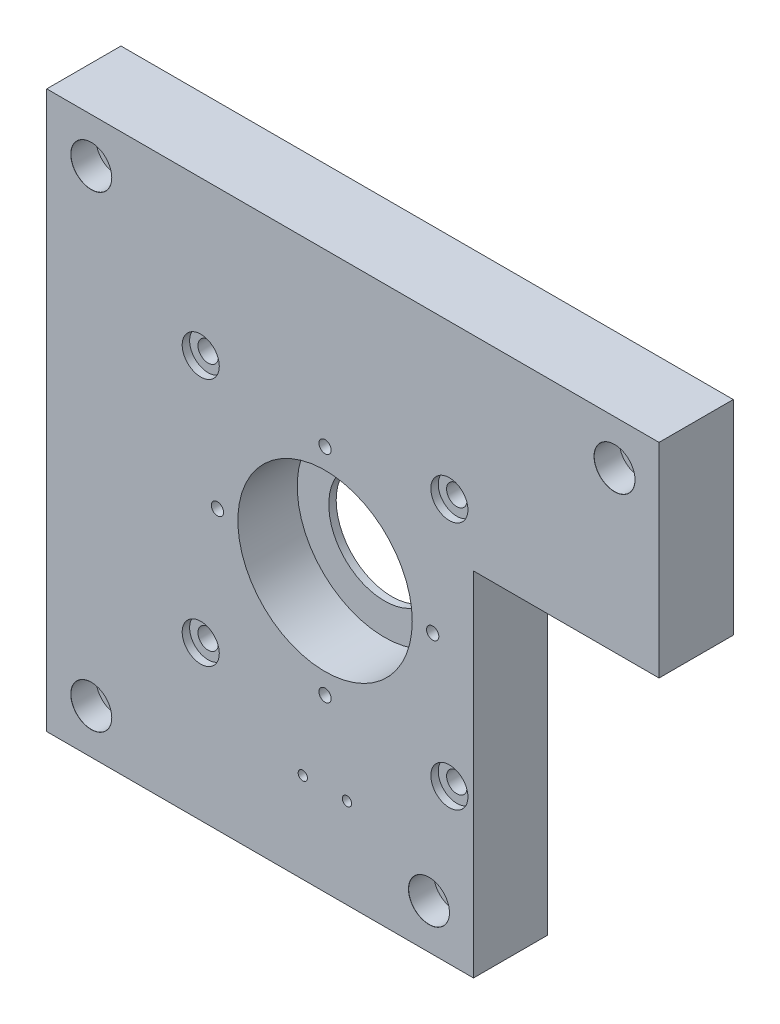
ISO-10303-21;
HEADER;
FILE_DESCRIPTION(('STEP AP214'),'2;1');
FILE_NAME('part.step','',(''),(''),'','','');
FILE_SCHEMA(('AUTOMOTIVE_DESIGN { 1 0 10303 214 1 1 1 1 }'));
ENDSEC;
DATA;
#1=APPLICATION_CONTEXT('core data for automotive mechanical design processes');
#2=APPLICATION_PROTOCOL_DEFINITION('international standard','automotive_design',2000,#1);
#3=PRODUCT_CONTEXT('',#1,'mechanical');
#4=PRODUCT('Part','Part','',(#3));
#5=PRODUCT_RELATED_PRODUCT_CATEGORY('part','',(#4));
#6=PRODUCT_DEFINITION_FORMATION('','',#4);
#7=PRODUCT_DEFINITION_CONTEXT('part definition',#1,'design');
#8=PRODUCT_DEFINITION('design','',#6,#7);
#9=PRODUCT_DEFINITION_SHAPE('','',#8);
#10=(LENGTH_UNIT() NAMED_UNIT(*) SI_UNIT(.MILLI.,.METRE.));
#11=(NAMED_UNIT(*) PLANE_ANGLE_UNIT() SI_UNIT($,.RADIAN.));
#12=(NAMED_UNIT(*) SI_UNIT($,.STERADIAN.) SOLID_ANGLE_UNIT());
#13=UNCERTAINTY_MEASURE_WITH_UNIT(LENGTH_MEASURE(1.E-05),#10,'distance_accuracy_value','');
#14=(GEOMETRIC_REPRESENTATION_CONTEXT(3) GLOBAL_UNCERTAINTY_ASSIGNED_CONTEXT((#13)) GLOBAL_UNIT_ASSIGNED_CONTEXT((#10,
#11,#12)) REPRESENTATION_CONTEXT('',''));
#15=CARTESIAN_POINT('',(0.,0.,0.));
#16=DIRECTION('',(0.,0.,1.));
#17=DIRECTION('',(1.,0.,0.));
#18=AXIS2_PLACEMENT_3D('',#15,#16,#17);
#19=CARTESIAN_POINT('',(0.,0.,-16.));
#20=DIRECTION('',(0.,0.,1.));
#21=DIRECTION('',(1.,0.,0.));
#22=AXIS2_PLACEMENT_3D('',#19,#20,#21);
#23=CYLINDRICAL_SURFACE('',#22,15.);
#24=CARTESIAN_POINT('',(0.,0.,4.));
#25=DIRECTION('',(0.,0.,1.));
#26=DIRECTION('',(1.,0.,0.));
#27=AXIS2_PLACEMENT_3D('',#24,#25,#26);
#28=CIRCLE('',#27,15.);
#29=CARTESIAN_POINT('',(15.,0.,4.));
#30=VERTEX_POINT('',#29);
#31=EDGE_CURVE('E319',#30,#30,#28,.T.);
#32=ORIENTED_EDGE('',*,*,#31,.T.);
#33=EDGE_LOOP('',(#32));
#34=FACE_BOUND('',#33,.T.);
#35=CARTESIAN_POINT('',(0.,0.,2.));
#36=DIRECTION('',(0.,0.,-1.));
#37=DIRECTION('',(-1.,0.,0.));
#38=AXIS2_PLACEMENT_3D('',#35,#36,#37);
#39=CIRCLE('',#38,15.);
#40=CARTESIAN_POINT('',(-15.,0.,2.));
#41=VERTEX_POINT('',#40);
#42=EDGE_CURVE('E20',#41,#41,#39,.F.);
#43=ORIENTED_EDGE('',*,*,#42,.F.);
#44=EDGE_LOOP('',(#43));
#45=FACE_BOUND('',#44,.T.);
#46=ADVANCED_FACE('F16',(#34,#45),#23,.F.);
#47=CARTESIAN_POINT('',(29.0000000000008,8.20678097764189E-13,20.));
#48=DIRECTION('',(0.,0.,1.));
#49=DIRECTION('',(1.,0.,0.));
#50=AXIS2_PLACEMENT_3D('',#47,#48,#49);
#51=CYLINDRICAL_SURFACE('',#50,1.65);
#52=CARTESIAN_POINT('',(29.0000000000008,8.20678097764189E-13,20.));
#53=DIRECTION('',(0.,0.,1.));
#54=DIRECTION('',(1.,0.,0.));
#55=AXIS2_PLACEMENT_3D('',#52,#53,#54);
#56=CIRCLE('',#55,1.65);
#57=CARTESIAN_POINT('',(30.6500000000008,8.20678097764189E-13,20.));
#58=VERTEX_POINT('',#57);
#59=EDGE_CURVE('E143',#58,#58,#56,.T.);
#60=ORIENTED_EDGE('',*,*,#59,.T.);
#61=EDGE_LOOP('',(#60));
#62=FACE_BOUND('',#61,.T.);
#63=CARTESIAN_POINT('',(29.0000000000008,8.20678097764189E-13,1.));
#64=DIRECTION('',(0.,0.,-1.));
#65=DIRECTION('',(-1.,0.,0.));
#66=AXIS2_PLACEMENT_3D('',#63,#64,#65);
#67=CIRCLE('',#66,1.65);
#68=CARTESIAN_POINT('',(27.3500000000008,8.20678097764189E-13,1.));
#69=VERTEX_POINT('',#68);
#70=EDGE_CURVE('E119',#69,#69,#67,.F.);
#71=ORIENTED_EDGE('',*,*,#70,.F.);
#72=EDGE_LOOP('',(#71));
#73=FACE_BOUND('',#72,.T.);
#74=ADVANCED_FACE('F373',(#62,#73),#51,.F.);
#75=CARTESIAN_POINT('',(1.64135619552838E-12,-29.,20.));
#76=DIRECTION('',(0.,0.,1.));
#77=DIRECTION('',(1.,0.,0.));
#78=AXIS2_PLACEMENT_3D('',#75,#76,#77);
#79=CYLINDRICAL_SURFACE('',#78,1.65);
#80=CARTESIAN_POINT('',(1.64135619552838E-12,-29.,20.));
#81=DIRECTION('',(0.,0.,1.));
#82=DIRECTION('',(1.,0.,0.));
#83=AXIS2_PLACEMENT_3D('',#80,#81,#82);
#84=CIRCLE('',#83,1.65);
#85=CARTESIAN_POINT('',(1.65000000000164,-29.,20.));
#86=VERTEX_POINT('',#85);
#87=EDGE_CURVE('E140',#86,#86,#84,.T.);
#88=ORIENTED_EDGE('',*,*,#87,.T.);
#89=EDGE_LOOP('',(#88));
#90=FACE_BOUND('',#89,.T.);
#91=CARTESIAN_POINT('',(1.64135619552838E-12,-29.,1.));
#92=DIRECTION('',(0.,0.,-1.));
#93=DIRECTION('',(-1.,0.,0.));
#94=AXIS2_PLACEMENT_3D('',#91,#92,#93);
#95=CIRCLE('',#94,1.65);
#96=CARTESIAN_POINT('',(-1.64999999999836,-29.,1.));
#97=VERTEX_POINT('',#96);
#98=EDGE_CURVE('E104',#97,#97,#95,.F.);
#99=ORIENTED_EDGE('',*,*,#98,.F.);
#100=EDGE_LOOP('',(#99));
#101=FACE_BOUND('',#100,.T.);
#102=ADVANCED_FACE('F379',(#90,#101),#79,.F.);
#103=CARTESIAN_POINT('',(-28.9999999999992,-8.17126622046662E-13,20.));
#104=DIRECTION('',(0.,0.,1.));
#105=DIRECTION('',(1.,0.,0.));
#106=AXIS2_PLACEMENT_3D('',#103,#104,#105);
#107=CYLINDRICAL_SURFACE('',#106,1.65);
#108=CARTESIAN_POINT('',(-28.9999999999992,-8.17126622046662E-13,20.));
#109=DIRECTION('',(0.,0.,1.));
#110=DIRECTION('',(1.,0.,0.));
#111=AXIS2_PLACEMENT_3D('',#108,#109,#110);
#112=CIRCLE('',#111,1.65);
#113=CARTESIAN_POINT('',(-27.3499999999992,-8.17126622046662E-13,20.));
#114=VERTEX_POINT('',#113);
#115=EDGE_CURVE('E137',#114,#114,#112,.T.);
#116=ORIENTED_EDGE('',*,*,#115,.T.);
#117=EDGE_LOOP('',(#116));
#118=FACE_BOUND('',#117,.T.);
#119=CARTESIAN_POINT('',(-28.9999999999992,-8.17126622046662E-13,1.));
#120=DIRECTION('',(0.,0.,-1.));
#121=DIRECTION('',(-1.,0.,0.));
#122=AXIS2_PLACEMENT_3D('',#119,#120,#121);
#123=CIRCLE('',#122,1.65);
#124=CARTESIAN_POINT('',(-30.6499999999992,-8.17126622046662E-13,1.));
#125=VERTEX_POINT('',#124);
#126=EDGE_CURVE('E99',#125,#125,#123,.F.);
#127=ORIENTED_EDGE('',*,*,#126,.F.);
#128=EDGE_LOOP('',(#127));
#129=FACE_BOUND('',#128,.T.);
#130=ADVANCED_FACE('F434',(#118,#129),#107,.F.);
#131=CARTESIAN_POINT('',(0.,29.,20.));
#132=DIRECTION('',(0.,0.,1.));
#133=DIRECTION('',(1.,0.,0.));
#134=AXIS2_PLACEMENT_3D('',#131,#132,#133);
#135=CYLINDRICAL_SURFACE('',#134,1.65);
#136=CARTESIAN_POINT('',(0.,29.,20.));
#137=DIRECTION('',(0.,0.,1.));
#138=DIRECTION('',(1.,0.,0.));
#139=AXIS2_PLACEMENT_3D('',#136,#137,#138);
#140=CIRCLE('',#139,1.65);
#141=CARTESIAN_POINT('',(1.65,29.,20.));
#142=VERTEX_POINT('',#141);
#143=EDGE_CURVE('E134',#142,#142,#140,.T.);
#144=ORIENTED_EDGE('',*,*,#143,.T.);
#145=EDGE_LOOP('',(#144));
#146=FACE_BOUND('',#145,.T.);
#147=CARTESIAN_POINT('',(0.,29.,1.));
#148=DIRECTION('',(0.,0.,-1.));
#149=DIRECTION('',(-1.,0.,0.));
#150=AXIS2_PLACEMENT_3D('',#147,#148,#149);
#151=CIRCLE('',#150,1.65);
#152=CARTESIAN_POINT('',(-1.65,29.,1.));
#153=VERTEX_POINT('',#152);
#154=EDGE_CURVE('E97',#153,#153,#151,.F.);
#155=ORIENTED_EDGE('',*,*,#154,.F.);
#156=EDGE_LOOP('',(#155));
#157=FACE_BOUND('',#156,.T.);
#158=ADVANCED_FACE('F430',(#146,#157),#135,.F.);
#159=CARTESIAN_POINT('',(-33.5000000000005,-33.5000000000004,0.));
#160=DIRECTION('',(0.,0.,-1.));
#161=DIRECTION('',(-1.,0.,0.));
#162=AXIS2_PLACEMENT_3D('',#159,#160,#161);
#163=CYLINDRICAL_SURFACE('',#162,2.75);
#164=CARTESIAN_POINT('',(-33.5000000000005,-33.5000000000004,5.4));
#165=DIRECTION('',(0.,0.,-1.));
#166=DIRECTION('',(-1.,0.,0.));
#167=AXIS2_PLACEMENT_3D('',#164,#165,#166);
#168=CIRCLE('',#167,2.75);
#169=CARTESIAN_POINT('',(-36.2500000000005,-33.5000000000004,5.4));
#170=VERTEX_POINT('',#169);
#171=EDGE_CURVE('E294',#170,#170,#168,.T.);
#172=ORIENTED_EDGE('',*,*,#171,.T.);
#173=EDGE_LOOP('',(#172));
#174=FACE_BOUND('',#173,.T.);
#175=CARTESIAN_POINT('',(-33.5000000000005,-33.5000000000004,18.));
#176=DIRECTION('',(0.,0.,1.));
#177=DIRECTION('',(1.,0.,0.));
#178=AXIS2_PLACEMENT_3D('',#175,#176,#177);
#179=CIRCLE('',#178,2.75);
#180=CARTESIAN_POINT('',(-30.7500000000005,-33.5000000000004,18.));
#181=VERTEX_POINT('',#180);
#182=EDGE_CURVE('E93',#181,#181,#179,.F.);
#183=ORIENTED_EDGE('',*,*,#182,.F.);
#184=EDGE_LOOP('',(#183));
#185=FACE_BOUND('',#184,.T.);
#186=ADVANCED_FACE('F433',(#174,#185),#163,.F.);
#187=CARTESIAN_POINT('',(33.4999999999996,-33.5,0.));
#188=DIRECTION('',(0.,0.,-1.));
#189=DIRECTION('',(-1.,0.,0.));
#190=AXIS2_PLACEMENT_3D('',#187,#188,#189);
#191=CYLINDRICAL_SURFACE('',#190,2.75);
#192=CARTESIAN_POINT('',(33.4999999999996,-33.5,5.4));
#193=DIRECTION('',(0.,0.,-1.));
#194=DIRECTION('',(-1.,0.,0.));
#195=AXIS2_PLACEMENT_3D('',#192,#193,#194);
#196=CIRCLE('',#195,2.75);
#197=CARTESIAN_POINT('',(30.7499999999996,-33.5,5.4));
#198=VERTEX_POINT('',#197);
#199=EDGE_CURVE('E303',#198,#198,#196,.T.);
#200=ORIENTED_EDGE('',*,*,#199,.T.);
#201=EDGE_LOOP('',(#200));
#202=FACE_BOUND('',#201,.T.);
#203=CARTESIAN_POINT('',(33.4999999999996,-33.5,18.));
#204=DIRECTION('',(0.,0.,1.));
#205=DIRECTION('',(1.,0.,0.));
#206=AXIS2_PLACEMENT_3D('',#203,#204,#205);
#207=CIRCLE('',#206,2.75);
#208=CARTESIAN_POINT('',(36.2499999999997,-33.5,18.));
#209=VERTEX_POINT('',#208);
#210=EDGE_CURVE('E88',#209,#209,#207,.F.);
#211=ORIENTED_EDGE('',*,*,#210,.F.);
#212=EDGE_LOOP('',(#211));
#213=FACE_BOUND('',#212,.T.);
#214=ADVANCED_FACE('F591',(#202,#213),#191,.F.);
#215=CARTESIAN_POINT('',(33.4999999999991,33.5,0.));
#216=DIRECTION('',(0.,0.,-1.));
#217=DIRECTION('',(-1.,0.,0.));
#218=AXIS2_PLACEMENT_3D('',#215,#216,#217);
#219=CYLINDRICAL_SURFACE('',#218,2.75);
#220=CARTESIAN_POINT('',(33.4999999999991,33.5,5.4));
#221=DIRECTION('',(0.,0.,-1.));
#222=DIRECTION('',(-1.,0.,0.));
#223=AXIS2_PLACEMENT_3D('',#220,#221,#222);
#224=CIRCLE('',#223,2.75);
#225=CARTESIAN_POINT('',(30.7499999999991,33.5,5.4));
#226=VERTEX_POINT('',#225);
#227=EDGE_CURVE('E276',#226,#226,#224,.T.);
#228=ORIENTED_EDGE('',*,*,#227,.T.);
#229=EDGE_LOOP('',(#228));
#230=FACE_BOUND('',#229,.T.);
#231=CARTESIAN_POINT('',(33.4999999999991,33.5,18.));
#232=DIRECTION('',(0.,0.,1.));
#233=DIRECTION('',(1.,0.,0.));
#234=AXIS2_PLACEMENT_3D('',#231,#232,#233);
#235=CIRCLE('',#234,2.75);
#236=CARTESIAN_POINT('',(36.2499999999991,33.5,18.));
#237=VERTEX_POINT('',#236);
#238=EDGE_CURVE('E83',#237,#237,#235,.F.);
#239=ORIENTED_EDGE('',*,*,#238,.F.);
#240=EDGE_LOOP('',(#239));
#241=FACE_BOUND('',#240,.T.);
#242=ADVANCED_FACE('F588',(#230,#241),#219,.F.);
#243=CARTESIAN_POINT('',(-33.5000000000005,33.5,0.));
#244=DIRECTION('',(0.,0.,-1.));
#245=DIRECTION('',(-1.,0.,0.));
#246=AXIS2_PLACEMENT_3D('',#243,#244,#245);
#247=CYLINDRICAL_SURFACE('',#246,2.75);
#248=CARTESIAN_POINT('',(-33.5000000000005,33.5,5.4));
#249=DIRECTION('',(0.,0.,-1.));
#250=DIRECTION('',(-1.,0.,0.));
#251=AXIS2_PLACEMENT_3D('',#248,#249,#250);
#252=CIRCLE('',#251,2.75);
#253=CARTESIAN_POINT('',(-36.2500000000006,33.5,5.4));
#254=VERTEX_POINT('',#253);
#255=EDGE_CURVE('E285',#254,#254,#252,.T.);
#256=ORIENTED_EDGE('',*,*,#255,.T.);
#257=EDGE_LOOP('',(#256));
#258=FACE_BOUND('',#257,.T.);
#259=CARTESIAN_POINT('',(-33.5000000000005,33.5,18.));
#260=DIRECTION('',(0.,0.,1.));
#261=DIRECTION('',(1.,0.,0.));
#262=AXIS2_PLACEMENT_3D('',#259,#260,#261);
#263=CIRCLE('',#262,2.75);
#264=CARTESIAN_POINT('',(-30.7500000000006,33.5,18.));
#265=VERTEX_POINT('',#264);
#266=EDGE_CURVE('E78',#265,#265,#263,.F.);
#267=ORIENTED_EDGE('',*,*,#266,.F.);
#268=EDGE_LOOP('',(#267));
#269=FACE_BOUND('',#268,.T.);
#270=ADVANCED_FACE('F405',(#258,#269),#247,.F.);
#271=CARTESIAN_POINT('',(-75.,75.,20.));
#272=DIRECTION('',(0.,-1.,0.));
#273=DIRECTION('',(0.,0.,-1.));
#274=AXIS2_PLACEMENT_3D('',#271,#272,#273);
#275=PLANE('',#274);
#276=DIRECTION('',(-1.,0.,0.));
#277=VECTOR('',#276,1.);
#278=CARTESIAN_POINT('',(-75.,75.,0.));
#279=LINE('',#278,#277);
#280=CARTESIAN_POINT('',(90.,75.,0.));
#281=VERTEX_POINT('',#280);
#282=CARTESIAN_POINT('',(-75.,75.,0.));
#283=VERTEX_POINT('',#282);
#284=EDGE_CURVE('E63',#281,#283,#279,.T.);
#285=ORIENTED_EDGE('',*,*,#284,.T.);
#286=DIRECTION('',(0.,0.,-1.));
#287=VECTOR('',#286,1.);
#288=CARTESIAN_POINT('',(-75.,75.,20.));
#289=LINE('',#288,#287);
#290=CARTESIAN_POINT('',(-75.,75.,20.));
#291=VERTEX_POINT('',#290);
#292=EDGE_CURVE('E11',#291,#283,#289,.T.);
#293=ORIENTED_EDGE('',*,*,#292,.F.);
#294=DIRECTION('',(-1.,0.,0.));
#295=VECTOR('',#294,1.);
#296=CARTESIAN_POINT('',(-75.,75.,20.));
#297=LINE('',#296,#295);
#298=CARTESIAN_POINT('',(90.,75.,20.));
#299=VERTEX_POINT('',#298);
#300=EDGE_CURVE('E73',#299,#291,#297,.T.);
#301=ORIENTED_EDGE('',*,*,#300,.F.);
#302=DIRECTION('',(0.,0.,1.));
#303=VECTOR('',#302,1.);
#304=CARTESIAN_POINT('',(90.,75.,0.));
#305=LINE('',#304,#303);
#306=EDGE_CURVE('E230',#281,#299,#305,.T.);
#307=ORIENTED_EDGE('',*,*,#306,.F.);
#308=EDGE_LOOP('',(#285,#293,#301,#307));
#309=FACE_BOUND('',#308,.T.);
#310=ADVANCED_FACE('F18',(#309),#275,.F.);
#311=CARTESIAN_POINT('',(-75.,75.,20.));
#312=DIRECTION('',(1.,0.,0.));
#313=DIRECTION('',(0.,1.,0.));
#314=AXIS2_PLACEMENT_3D('',#311,#312,#313);
#315=PLANE('',#314);
#316=CARTESIAN_POINT('',(-75.,9.,9.99999999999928));
#317=DIRECTION('',(-1.,0.,0.));
#318=DIRECTION('',(0.,0.,1.));
#319=AXIS2_PLACEMENT_3D('',#316,#317,#318);
#320=CIRCLE('',#319,1.25);
#321=CARTESIAN_POINT('',(-75.,9.,11.2499999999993));
#322=VERTEX_POINT('',#321);
#323=EDGE_CURVE('E122',#322,#322,#320,.T.);
#324=ORIENTED_EDGE('',*,*,#323,.F.);
#325=EDGE_LOOP('',(#324));
#326=FACE_BOUND('',#325,.T.);
#327=CARTESIAN_POINT('',(-75.,-7.,9.99999999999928));
#328=DIRECTION('',(-1.,0.,0.));
#329=DIRECTION('',(0.,0.,1.));
#330=AXIS2_PLACEMENT_3D('',#327,#328,#329);
#331=CIRCLE('',#330,1.25);
#332=CARTESIAN_POINT('',(-75.,-7.,11.2499999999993));
#333=VERTEX_POINT('',#332);
#334=EDGE_CURVE('E128',#333,#333,#331,.T.);
#335=ORIENTED_EDGE('',*,*,#334,.F.);
#336=EDGE_LOOP('',(#335));
#337=FACE_BOUND('',#336,.T.);
#338=DIRECTION('',(0.,-1.,0.));
#339=VECTOR('',#338,1.);
#340=CARTESIAN_POINT('',(-75.,75.,0.));
#341=LINE('',#340,#339);
#342=CARTESIAN_POINT('',(-75.,-75.,0.));
#343=VERTEX_POINT('',#342);
#344=EDGE_CURVE('E54',#283,#343,#341,.T.);
#345=ORIENTED_EDGE('',*,*,#344,.T.);
#346=DIRECTION('',(0.,0.,-1.));
#347=VECTOR('',#346,1.);
#348=CARTESIAN_POINT('',(-75.,-75.,20.));
#349=LINE('',#348,#347);
#350=CARTESIAN_POINT('',(-75.,-75.,20.));
#351=VERTEX_POINT('',#350);
#352=EDGE_CURVE('E25',#351,#343,#349,.T.);
#353=ORIENTED_EDGE('',*,*,#352,.F.);
#354=DIRECTION('',(0.,-1.,0.));
#355=VECTOR('',#354,1.);
#356=CARTESIAN_POINT('',(-75.,75.,20.));
#357=LINE('',#356,#355);
#358=EDGE_CURVE('E42',#291,#351,#357,.T.);
#359=ORIENTED_EDGE('',*,*,#358,.F.);
#360=ORIENTED_EDGE('',*,*,#292,.T.);
#361=EDGE_LOOP('',(#345,#353,#359,#360));
#362=FACE_BOUND('',#361,.T.);
#363=ADVANCED_FACE('F56',(#326,#337,#362),#315,.F.);
#364=CARTESIAN_POINT('',(-75.,-75.,20.));
#365=DIRECTION('',(0.,1.,0.));
#366=DIRECTION('',(-1.,0.,0.));
#367=AXIS2_PLACEMENT_3D('',#364,#365,#366);
#368=PLANE('',#367);
#369=DIRECTION('',(1.,0.,0.));
#370=VECTOR('',#369,1.);
#371=CARTESIAN_POINT('',(-75.,-75.,0.));
#372=LINE('',#371,#370);
#373=CARTESIAN_POINT('',(40.,-75.,0.));
#374=VERTEX_POINT('',#373);
#375=EDGE_CURVE('E62',#343,#374,#372,.T.);
#376=ORIENTED_EDGE('',*,*,#375,.T.);
#377=DIRECTION('',(0.,0.,-1.));
#378=VECTOR('',#377,1.);
#379=CARTESIAN_POINT('',(40.,-75.,20.));
#380=LINE('',#379,#378);
#381=CARTESIAN_POINT('',(40.,-75.,20.));
#382=VERTEX_POINT('',#381);
#383=EDGE_CURVE('E33',#382,#374,#380,.T.);
#384=ORIENTED_EDGE('',*,*,#383,.F.);
#385=DIRECTION('',(1.,0.,0.));
#386=VECTOR('',#385,1.);
#387=CARTESIAN_POINT('',(-75.,-75.,20.));
#388=LINE('',#387,#386);
#389=EDGE_CURVE('E68',#351,#382,#388,.T.);
#390=ORIENTED_EDGE('',*,*,#389,.F.);
#391=ORIENTED_EDGE('',*,*,#352,.T.);
#392=EDGE_LOOP('',(#376,#384,#390,#391));
#393=FACE_BOUND('',#392,.T.);
#394=ADVANCED_FACE('F67',(#393),#368,.F.);
#395=CARTESIAN_POINT('',(0.,0.,20.));
#396=DIRECTION('',(0.,0.,1.));
#397=DIRECTION('',(1.,0.,0.));
#398=AXIS2_PLACEMENT_3D('',#395,#396,#397);
#399=PLANE('',#398);
#400=ORIENTED_EDGE('',*,*,#143,.F.);
#401=EDGE_LOOP('',(#400));
#402=FACE_BOUND('',#401,.T.);
#403=ORIENTED_EDGE('',*,*,#115,.F.);
#404=EDGE_LOOP('',(#403));
#405=FACE_BOUND('',#404,.T.);
#406=ORIENTED_EDGE('',*,*,#87,.F.);
#407=EDGE_LOOP('',(#406));
#408=FACE_BOUND('',#407,.T.);
#409=ORIENTED_EDGE('',*,*,#59,.F.);
#410=EDGE_LOOP('',(#409));
#411=FACE_BOUND('',#410,.T.);
#412=CARTESIAN_POINT('',(-63.,63.,20.));
#413=DIRECTION('',(0.,0.,1.));
#414=DIRECTION('',(1.,0.,0.));
#415=AXIS2_PLACEMENT_3D('',#412,#413,#414);
#416=CIRCLE('',#415,5.525);
#417=CARTESIAN_POINT('',(-57.475,63.,20.));
#418=VERTEX_POINT('',#417);
#419=EDGE_CURVE('E149',#418,#418,#416,.T.);
#420=ORIENTED_EDGE('',*,*,#419,.F.);
#421=EDGE_LOOP('',(#420));
#422=FACE_BOUND('',#421,.T.);
#423=CARTESIAN_POINT('',(-63.,-63.,20.));
#424=DIRECTION('',(0.,0.,1.));
#425=DIRECTION('',(1.,0.,0.));
#426=AXIS2_PLACEMENT_3D('',#423,#424,#425);
#427=CIRCLE('',#426,5.525);
#428=CARTESIAN_POINT('',(-57.475,-63.,20.));
#429=VERTEX_POINT('',#428);
#430=EDGE_CURVE('E170',#429,#429,#427,.T.);
#431=ORIENTED_EDGE('',*,*,#430,.F.);
#432=EDGE_LOOP('',(#431));
#433=FACE_BOUND('',#432,.T.);
#434=CARTESIAN_POINT('',(28.,-63.,20.));
#435=DIRECTION('',(0.,0.,1.));
#436=DIRECTION('',(1.,0.,0.));
#437=AXIS2_PLACEMENT_3D('',#434,#435,#436);
#438=CIRCLE('',#437,5.525);
#439=CARTESIAN_POINT('',(33.525,-63.,20.));
#440=VERTEX_POINT('',#439);
#441=EDGE_CURVE('E191',#440,#440,#438,.T.);
#442=ORIENTED_EDGE('',*,*,#441,.F.);
#443=EDGE_LOOP('',(#442));
#444=FACE_BOUND('',#443,.T.);
#445=CARTESIAN_POINT('',(78.,63.,20.));
#446=DIRECTION('',(0.,0.,1.));
#447=DIRECTION('',(1.,0.,0.));
#448=AXIS2_PLACEMENT_3D('',#445,#446,#447);
#449=CIRCLE('',#448,5.525);
#450=CARTESIAN_POINT('',(83.525,63.,20.));
#451=VERTEX_POINT('',#450);
#452=EDGE_CURVE('E212',#451,#451,#449,.T.);
#453=ORIENTED_EDGE('',*,*,#452,.F.);
#454=EDGE_LOOP('',(#453));
#455=FACE_BOUND('',#454,.T.);
#456=CARTESIAN_POINT('',(5.90059711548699,-50.75,20.));
#457=DIRECTION('',(0.,0.,1.));
#458=DIRECTION('',(1.,0.,0.));
#459=AXIS2_PLACEMENT_3D('',#456,#457,#458);
#460=CIRCLE('',#459,1.25);
#461=CARTESIAN_POINT('',(7.15059711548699,-50.75,20.));
#462=VERTEX_POINT('',#461);
#463=EDGE_CURVE('E242',#462,#462,#460,.T.);
#464=ORIENTED_EDGE('',*,*,#463,.F.);
#465=EDGE_LOOP('',(#464));
#466=FACE_BOUND('',#465,.T.);
#467=CARTESIAN_POINT('',(-6.,-50.75,20.));
#468=DIRECTION('',(0.,0.,1.));
#469=DIRECTION('',(1.,0.,0.));
#470=AXIS2_PLACEMENT_3D('',#467,#468,#469);
#471=CIRCLE('',#470,1.25);
#472=CARTESIAN_POINT('',(-4.75,-50.75,20.));
#473=VERTEX_POINT('',#472);
#474=EDGE_CURVE('E248',#473,#473,#471,.T.);
#475=ORIENTED_EDGE('',*,*,#474,.F.);
#476=EDGE_LOOP('',(#475));
#477=FACE_BOUND('',#476,.T.);
#478=CARTESIAN_POINT('',(-33.5000000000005,-33.5000000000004,20.));
#479=DIRECTION('',(0.,0.,1.));
#480=DIRECTION('',(1.,0.,0.));
#481=AXIS2_PLACEMENT_3D('',#478,#479,#480);
#482=CIRCLE('',#481,5.);
#483=CARTESIAN_POINT('',(-28.5000000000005,-33.5000000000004,20.));
#484=VERTEX_POINT('',#483);
#485=EDGE_CURVE('E254',#484,#484,#482,.T.);
#486=ORIENTED_EDGE('',*,*,#485,.F.);
#487=EDGE_LOOP('',(#486));
#488=FACE_BOUND('',#487,.T.);
#489=CARTESIAN_POINT('',(33.4999999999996,-33.5,20.));
#490=DIRECTION('',(0.,0.,1.));
#491=DIRECTION('',(1.,0.,0.));
#492=AXIS2_PLACEMENT_3D('',#489,#490,#491);
#493=CIRCLE('',#492,5.);
#494=CARTESIAN_POINT('',(38.4999999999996,-33.5,20.));
#495=VERTEX_POINT('',#494);
#496=EDGE_CURVE('E95',#495,#495,#493,.T.);
#497=ORIENTED_EDGE('',*,*,#496,.F.);
#498=EDGE_LOOP('',(#497));
#499=FACE_BOUND('',#498,.T.);
#500=CARTESIAN_POINT('',(33.4999999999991,33.5,20.));
#501=DIRECTION('',(0.,0.,1.));
#502=DIRECTION('',(1.,0.,0.));
#503=AXIS2_PLACEMENT_3D('',#500,#501,#502);
#504=CIRCLE('',#503,5.);
#505=CARTESIAN_POINT('',(38.4999999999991,33.5,20.));
#506=VERTEX_POINT('',#505);
#507=EDGE_CURVE('E91',#506,#506,#504,.T.);
#508=ORIENTED_EDGE('',*,*,#507,.F.);
#509=EDGE_LOOP('',(#508));
#510=FACE_BOUND('',#509,.T.);
#511=CARTESIAN_POINT('',(-33.5000000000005,33.5,20.));
#512=DIRECTION('',(0.,0.,1.));
#513=DIRECTION('',(1.,0.,0.));
#514=AXIS2_PLACEMENT_3D('',#511,#512,#513);
#515=CIRCLE('',#514,5.);
#516=CARTESIAN_POINT('',(-28.5000000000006,33.5,20.));
#517=VERTEX_POINT('',#516);
#518=EDGE_CURVE('E86',#517,#517,#515,.T.);
#519=ORIENTED_EDGE('',*,*,#518,.F.);
#520=EDGE_LOOP('',(#519));
#521=FACE_BOUND('',#520,.T.);
#522=DIRECTION('',(1.,0.,0.));
#523=VECTOR('',#522,1.);
#524=CARTESIAN_POINT('',(75.,20.,20.));
#525=LINE('',#524,#523);
#526=CARTESIAN_POINT('',(40.,20.,20.));
#527=VERTEX_POINT('',#526);
#528=CARTESIAN_POINT('',(90.,20.,20.));
#529=VERTEX_POINT('',#528);
#530=EDGE_CURVE('E309',#527,#529,#525,.T.);
#531=ORIENTED_EDGE('',*,*,#530,.T.);
#532=DIRECTION('',(0.,-1.,0.));
#533=VECTOR('',#532,1.);
#534=CARTESIAN_POINT('',(90.,75.,20.));
#535=LINE('',#534,#533);
#536=EDGE_CURVE('E233',#299,#529,#535,.T.);
#537=ORIENTED_EDGE('',*,*,#536,.F.);
#538=ORIENTED_EDGE('',*,*,#300,.T.);
#539=ORIENTED_EDGE('',*,*,#358,.T.);
#540=ORIENTED_EDGE('',*,*,#389,.T.);
#541=DIRECTION('',(0.,1.,0.));
#542=VECTOR('',#541,1.);
#543=CARTESIAN_POINT('',(40.,-75.,20.));
#544=LINE('',#543,#542);
#545=EDGE_CURVE('E306',#382,#527,#544,.T.);
#546=ORIENTED_EDGE('',*,*,#545,.T.);
#547=EDGE_LOOP('',(#531,#537,#538,#539,#540,#546));
#548=FACE_BOUND('',#547,.T.);
#549=CARTESIAN_POINT('',(0.,0.,20.));
#550=DIRECTION('',(0.,0.,1.));
#551=DIRECTION('',(1.,0.,0.));
#552=AXIS2_PLACEMENT_3D('',#549,#550,#551);
#553=CIRCLE('',#552,23.5);
#554=CARTESIAN_POINT('',(23.5,0.,20.));
#555=VERTEX_POINT('',#554);
#556=EDGE_CURVE('E323',#555,#555,#553,.T.);
#557=ORIENTED_EDGE('',*,*,#556,.F.);
#558=EDGE_LOOP('',(#557));
#559=FACE_BOUND('',#558,.T.);
#560=ADVANCED_FACE('F391',(#402,#405,#408,#411,#422,#433,#444,#455,#466,#477,#488,#499,#510,
#521,#548,#559),#399,.T.);
#561=CARTESIAN_POINT('',(0.,0.,0.));
#562=DIRECTION('',(0.,0.,1.));
#563=DIRECTION('',(1.,0.,0.));
#564=AXIS2_PLACEMENT_3D('',#561,#562,#563);
#565=PLANE('',#564);
#566=CARTESIAN_POINT('',(0.,0.,0.));
#567=DIRECTION('',(0.,0.,-1.));
#568=DIRECTION('',(-1.,0.,0.));
#569=AXIS2_PLACEMENT_3D('',#566,#567,#568);
#570=CIRCLE('',#569,31.);
#571=CARTESIAN_POINT('',(-31.,0.,0.));
#572=VERTEX_POINT('',#571);
#573=EDGE_CURVE('E107',#572,#572,#570,.T.);
#574=ORIENTED_EDGE('',*,*,#573,.F.);
#575=EDGE_LOOP('',(#574));
#576=FACE_BOUND('',#575,.T.);
#577=CARTESIAN_POINT('',(-63.,63.,0.));
#578=DIRECTION('',(0.,0.,1.));
#579=DIRECTION('',(1.,0.,0.));
#580=AXIS2_PLACEMENT_3D('',#577,#578,#579);
#581=CIRCLE('',#580,3.325);
#582=CARTESIAN_POINT('',(-59.675,63.,0.));
#583=VERTEX_POINT('',#582);
#584=EDGE_CURVE('E146',#583,#583,#581,.T.);
#585=ORIENTED_EDGE('',*,*,#584,.T.);
#586=EDGE_LOOP('',(#585));
#587=FACE_BOUND('',#586,.T.);
#588=CARTESIAN_POINT('',(-63.,-63.,0.));
#589=DIRECTION('',(0.,0.,1.));
#590=DIRECTION('',(1.,0.,0.));
#591=AXIS2_PLACEMENT_3D('',#588,#589,#590);
#592=CIRCLE('',#591,3.325);
#593=CARTESIAN_POINT('',(-59.675,-63.,0.));
#594=VERTEX_POINT('',#593);
#595=EDGE_CURVE('E167',#594,#594,#592,.T.);
#596=ORIENTED_EDGE('',*,*,#595,.T.);
#597=EDGE_LOOP('',(#596));
#598=FACE_BOUND('',#597,.T.);
#599=CARTESIAN_POINT('',(28.,-63.,0.));
#600=DIRECTION('',(0.,0.,1.));
#601=DIRECTION('',(1.,0.,0.));
#602=AXIS2_PLACEMENT_3D('',#599,#600,#601);
#603=CIRCLE('',#602,3.325);
#604=CARTESIAN_POINT('',(31.325,-63.,0.));
#605=VERTEX_POINT('',#604);
#606=EDGE_CURVE('E188',#605,#605,#603,.T.);
#607=ORIENTED_EDGE('',*,*,#606,.T.);
#608=EDGE_LOOP('',(#607));
#609=FACE_BOUND('',#608,.T.);
#610=CARTESIAN_POINT('',(78.,63.,0.));
#611=DIRECTION('',(0.,0.,1.));
#612=DIRECTION('',(1.,0.,0.));
#613=AXIS2_PLACEMENT_3D('',#610,#611,#612);
#614=CIRCLE('',#613,3.325);
#615=CARTESIAN_POINT('',(81.325,63.,0.));
#616=VERTEX_POINT('',#615);
#617=EDGE_CURVE('E209',#616,#616,#614,.T.);
#618=ORIENTED_EDGE('',*,*,#617,.T.);
#619=EDGE_LOOP('',(#618));
#620=FACE_BOUND('',#619,.T.);
#621=CARTESIAN_POINT('',(5.90059711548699,-50.75,0.));
#622=DIRECTION('',(0.,0.,1.));
#623=DIRECTION('',(1.,0.,0.));
#624=AXIS2_PLACEMENT_3D('',#621,#622,#623);
#625=CIRCLE('',#624,1.25);
#626=CARTESIAN_POINT('',(7.15059711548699,-50.75,0.));
#627=VERTEX_POINT('',#626);
#628=EDGE_CURVE('E245',#627,#627,#625,.T.);
#629=ORIENTED_EDGE('',*,*,#628,.T.);
#630=EDGE_LOOP('',(#629));
#631=FACE_BOUND('',#630,.T.);
#632=CARTESIAN_POINT('',(-6.,-50.75,0.));
#633=DIRECTION('',(0.,0.,1.));
#634=DIRECTION('',(1.,0.,0.));
#635=AXIS2_PLACEMENT_3D('',#632,#633,#634);
#636=CIRCLE('',#635,1.25);
#637=CARTESIAN_POINT('',(-4.75,-50.75,0.));
#638=VERTEX_POINT('',#637);
#639=EDGE_CURVE('E251',#638,#638,#636,.T.);
#640=ORIENTED_EDGE('',*,*,#639,.T.);
#641=EDGE_LOOP('',(#640));
#642=FACE_BOUND('',#641,.T.);
#643=CARTESIAN_POINT('',(33.4999999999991,33.5,0.));
#644=DIRECTION('',(0.,0.,-1.));
#645=DIRECTION('',(-1.,0.,0.));
#646=AXIS2_PLACEMENT_3D('',#643,#644,#645);
#647=CIRCLE('',#646,5.);
#648=CARTESIAN_POINT('',(28.4999999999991,33.5,0.));
#649=VERTEX_POINT('',#648);
#650=EDGE_CURVE('E81',#649,#649,#647,.T.);
#651=ORIENTED_EDGE('',*,*,#650,.F.);
#652=EDGE_LOOP('',(#651));
#653=FACE_BOUND('',#652,.T.);
#654=CARTESIAN_POINT('',(-33.5000000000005,33.5,0.));
#655=DIRECTION('',(0.,0.,-1.));
#656=DIRECTION('',(-1.,0.,0.));
#657=AXIS2_PLACEMENT_3D('',#654,#655,#656);
#658=CIRCLE('',#657,5.);
#659=CARTESIAN_POINT('',(-38.5000000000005,33.5,0.));
#660=VERTEX_POINT('',#659);
#661=EDGE_CURVE('E279',#660,#660,#658,.T.);
#662=ORIENTED_EDGE('',*,*,#661,.F.);
#663=EDGE_LOOP('',(#662));
#664=FACE_BOUND('',#663,.T.);
#665=CARTESIAN_POINT('',(-33.5000000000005,-33.5000000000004,0.));
#666=DIRECTION('',(0.,0.,-1.));
#667=DIRECTION('',(-1.,0.,0.));
#668=AXIS2_PLACEMENT_3D('',#665,#666,#667);
#669=CIRCLE('',#668,5.);
#670=CARTESIAN_POINT('',(-38.5000000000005,-33.5000000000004,0.));
#671=VERTEX_POINT('',#670);
#672=EDGE_CURVE('E288',#671,#671,#669,.T.);
#673=ORIENTED_EDGE('',*,*,#672,.F.);
#674=EDGE_LOOP('',(#673));
#675=FACE_BOUND('',#674,.T.);
#676=CARTESIAN_POINT('',(33.4999999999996,-33.5,0.));
#677=DIRECTION('',(0.,0.,-1.));
#678=DIRECTION('',(-1.,0.,0.));
#679=AXIS2_PLACEMENT_3D('',#676,#677,#678);
#680=CIRCLE('',#679,5.);
#681=CARTESIAN_POINT('',(28.4999999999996,-33.5,0.));
#682=VERTEX_POINT('',#681);
#683=EDGE_CURVE('E297',#682,#682,#680,.T.);
#684=ORIENTED_EDGE('',*,*,#683,.F.);
#685=EDGE_LOOP('',(#684));
#686=FACE_BOUND('',#685,.T.);
#687=ORIENTED_EDGE('',*,*,#284,.F.);
#688=DIRECTION('',(0.,1.,0.));
#689=VECTOR('',#688,1.);
#690=CARTESIAN_POINT('',(90.,20.,0.));
#691=LINE('',#690,#689);
#692=CARTESIAN_POINT('',(90.,20.,0.));
#693=VERTEX_POINT('',#692);
#694=EDGE_CURVE('E239',#693,#281,#691,.T.);
#695=ORIENTED_EDGE('',*,*,#694,.F.);
#696=DIRECTION('',(1.,0.,0.));
#697=VECTOR('',#696,1.);
#698=CARTESIAN_POINT('',(75.,20.,0.));
#699=LINE('',#698,#697);
#700=CARTESIAN_POINT('',(40.,20.,0.));
#701=VERTEX_POINT('',#700);
#702=EDGE_CURVE('E310',#701,#693,#699,.T.);
#703=ORIENTED_EDGE('',*,*,#702,.F.);
#704=DIRECTION('',(0.,1.,0.));
#705=VECTOR('',#704,1.);
#706=CARTESIAN_POINT('',(40.,-75.,0.));
#707=LINE('',#706,#705);
#708=EDGE_CURVE('E72',#374,#701,#707,.T.);
#709=ORIENTED_EDGE('',*,*,#708,.F.);
#710=ORIENTED_EDGE('',*,*,#375,.F.);
#711=ORIENTED_EDGE('',*,*,#344,.F.);
#712=EDGE_LOOP('',(#687,#695,#703,#709,#710,#711));
#713=FACE_BOUND('',#712,.T.);
#714=ADVANCED_FACE('F70',(#576,#587,#598,#609,#620,#631,#642,#653,#664,#675,#686,#713),#565,.F.);
#715=CARTESIAN_POINT('',(0.,0.,4.));
#716=DIRECTION('',(0.,0.,1.));
#717=DIRECTION('',(1.,0.,0.));
#718=AXIS2_PLACEMENT_3D('',#715,#716,#717);
#719=CYLINDRICAL_SURFACE('',#718,23.5);
#720=CARTESIAN_POINT('',(0.,0.,4.));
#721=DIRECTION('',(0.,0.,1.));
#722=DIRECTION('',(1.,0.,0.));
#723=AXIS2_PLACEMENT_3D('',#720,#721,#722);
#724=CIRCLE('',#723,23.5);
#725=CARTESIAN_POINT('',(23.5,0.,4.));
#726=VERTEX_POINT('',#725);
#727=EDGE_CURVE('E324',#726,#726,#724,.T.);
#728=ORIENTED_EDGE('',*,*,#727,.F.);
#729=EDGE_LOOP('',(#728));
#730=FACE_BOUND('',#729,.T.);
#731=ORIENTED_EDGE('',*,*,#556,.T.);
#732=EDGE_LOOP('',(#731));
#733=FACE_BOUND('',#732,.T.);
#734=ADVANCED_FACE('F386',(#730,#733),#719,.F.);
#735=CARTESIAN_POINT('',(0.,0.,4.));
#736=DIRECTION('',(0.,0.,1.));
#737=DIRECTION('',(1.,0.,0.));
#738=AXIS2_PLACEMENT_3D('',#735,#736,#737);
#739=PLANE('',#738);
#740=ORIENTED_EDGE('',*,*,#31,.F.);
#741=EDGE_LOOP('',(#740));
#742=FACE_BOUND('',#741,.T.);
#743=ORIENTED_EDGE('',*,*,#727,.T.);
#744=EDGE_LOOP('',(#743));
#745=FACE_BOUND('',#744,.T.);
#746=ADVANCED_FACE('F369',(#742,#745),#739,.T.);
#747=CARTESIAN_POINT('',(75.,20.,20.));
#748=DIRECTION('',(0.,1.,0.));
#749=DIRECTION('',(0.,0.,1.));
#750=AXIS2_PLACEMENT_3D('',#747,#748,#749);
#751=PLANE('',#750);
#752=ORIENTED_EDGE('',*,*,#702,.T.);
#753=DIRECTION('',(0.,0.,-1.));
#754=VECTOR('',#753,1.);
#755=CARTESIAN_POINT('',(90.,20.,20.));
#756=LINE('',#755,#754);
#757=EDGE_CURVE('E236',#529,#693,#756,.T.);
#758=ORIENTED_EDGE('',*,*,#757,.F.);
#759=ORIENTED_EDGE('',*,*,#530,.F.);
#760=DIRECTION('',(0.,0.,-1.));
#761=VECTOR('',#760,1.);
#762=CARTESIAN_POINT('',(40.,20.,20.));
#763=LINE('',#762,#761);
#764=EDGE_CURVE('E316',#527,#701,#763,.T.);
#765=ORIENTED_EDGE('',*,*,#764,.T.);
#766=EDGE_LOOP('',(#752,#758,#759,#765));
#767=FACE_BOUND('',#766,.T.);
#768=ADVANCED_FACE('F347',(#767),#751,.F.);
#769=CARTESIAN_POINT('',(40.,-75.,20.));
#770=DIRECTION('',(-1.,0.,0.));
#771=DIRECTION('',(0.,0.,1.));
#772=AXIS2_PLACEMENT_3D('',#769,#770,#771);
#773=PLANE('',#772);
#774=ORIENTED_EDGE('',*,*,#708,.T.);
#775=ORIENTED_EDGE('',*,*,#764,.F.);
#776=ORIENTED_EDGE('',*,*,#545,.F.);
#777=ORIENTED_EDGE('',*,*,#383,.T.);
#778=EDGE_LOOP('',(#774,#775,#776,#777));
#779=FACE_BOUND('',#778,.T.);
#780=ADVANCED_FACE('F356',(#779),#773,.F.);
#781=CARTESIAN_POINT('',(36.25,-33.5,5.4));
#782=DIRECTION('',(0.,0.,1.));
#783=DIRECTION('',(1.,0.,0.));
#784=AXIS2_PLACEMENT_3D('',#781,#782,#783);
#785=PLANE('',#784);
#786=ORIENTED_EDGE('',*,*,#199,.F.);
#787=EDGE_LOOP('',(#786));
#788=FACE_BOUND('',#787,.T.);
#789=CARTESIAN_POINT('',(33.4999999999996,-33.5,5.4));
#790=DIRECTION('',(0.,0.,-1.));
#791=DIRECTION('',(-1.,0.,0.));
#792=AXIS2_PLACEMENT_3D('',#789,#790,#791);
#793=CIRCLE('',#792,5.);
#794=CARTESIAN_POINT('',(28.4999999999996,-33.5,5.4));
#795=VERTEX_POINT('',#794);
#796=EDGE_CURVE('E300',#795,#795,#793,.T.);
#797=ORIENTED_EDGE('',*,*,#796,.T.);
#798=EDGE_LOOP('',(#797));
#799=FACE_BOUND('',#798,.T.);
#800=ADVANCED_FACE('F358',(#788,#799),#785,.F.);
#801=CARTESIAN_POINT('',(33.4999999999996,-33.5,0.));
#802=DIRECTION('',(0.,0.,-1.));
#803=DIRECTION('',(-1.,0.,0.));
#804=AXIS2_PLACEMENT_3D('',#801,#802,#803);
#805=CYLINDRICAL_SURFACE('',#804,5.);
#806=ORIENTED_EDGE('',*,*,#796,.F.);
#807=EDGE_LOOP('',(#806));
#808=FACE_BOUND('',#807,.T.);
#809=ORIENTED_EDGE('',*,*,#683,.T.);
#810=EDGE_LOOP('',(#809));
#811=FACE_BOUND('',#810,.T.);
#812=ADVANCED_FACE('F366',(#808,#811),#805,.F.);
#813=CARTESIAN_POINT('',(-30.7500000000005,-33.5000000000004,5.4));
#814=DIRECTION('',(0.,0.,1.));
#815=DIRECTION('',(1.,0.,0.));
#816=AXIS2_PLACEMENT_3D('',#813,#814,#815);
#817=PLANE('',#816);
#818=ORIENTED_EDGE('',*,*,#171,.F.);
#819=EDGE_LOOP('',(#818));
#820=FACE_BOUND('',#819,.T.);
#821=CARTESIAN_POINT('',(-33.5000000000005,-33.5000000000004,5.4));
#822=DIRECTION('',(0.,0.,-1.));
#823=DIRECTION('',(-1.,0.,0.));
#824=AXIS2_PLACEMENT_3D('',#821,#822,#823);
#825=CIRCLE('',#824,5.);
#826=CARTESIAN_POINT('',(-38.5000000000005,-33.5000000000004,5.4));
#827=VERTEX_POINT('',#826);
#828=EDGE_CURVE('E291',#827,#827,#825,.T.);
#829=ORIENTED_EDGE('',*,*,#828,.T.);
#830=EDGE_LOOP('',(#829));
#831=FACE_BOUND('',#830,.T.);
#832=ADVANCED_FACE('F606',(#820,#831),#817,.F.);
#833=CARTESIAN_POINT('',(-33.5000000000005,-33.5000000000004,0.));
#834=DIRECTION('',(0.,0.,-1.));
#835=DIRECTION('',(-1.,0.,0.));
#836=AXIS2_PLACEMENT_3D('',#833,#834,#835);
#837=CYLINDRICAL_SURFACE('',#836,5.);
#838=ORIENTED_EDGE('',*,*,#828,.F.);
#839=EDGE_LOOP('',(#838));
#840=FACE_BOUND('',#839,.T.);
#841=ORIENTED_EDGE('',*,*,#672,.T.);
#842=EDGE_LOOP('',(#841));
#843=FACE_BOUND('',#842,.T.);
#844=ADVANCED_FACE('F599',(#840,#843),#837,.F.);
#845=CARTESIAN_POINT('',(-30.7500000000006,33.5,5.4));
#846=DIRECTION('',(0.,0.,1.));
#847=DIRECTION('',(1.,0.,0.));
#848=AXIS2_PLACEMENT_3D('',#845,#846,#847);
#849=PLANE('',#848);
#850=ORIENTED_EDGE('',*,*,#255,.F.);
#851=EDGE_LOOP('',(#850));
#852=FACE_BOUND('',#851,.T.);
#853=CARTESIAN_POINT('',(-33.5000000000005,33.5,5.4));
#854=DIRECTION('',(0.,0.,-1.));
#855=DIRECTION('',(-1.,0.,0.));
#856=AXIS2_PLACEMENT_3D('',#853,#854,#855);
#857=CIRCLE('',#856,5.);
#858=CARTESIAN_POINT('',(-38.5000000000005,33.5,5.4));
#859=VERTEX_POINT('',#858);
#860=EDGE_CURVE('E282',#859,#859,#857,.T.);
#861=ORIENTED_EDGE('',*,*,#860,.T.);
#862=EDGE_LOOP('',(#861));
#863=FACE_BOUND('',#862,.T.);
#864=ADVANCED_FACE('F595',(#852,#863),#849,.F.);
#865=CARTESIAN_POINT('',(-33.5000000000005,33.5,0.));
#866=DIRECTION('',(0.,0.,-1.));
#867=DIRECTION('',(-1.,0.,0.));
#868=AXIS2_PLACEMENT_3D('',#865,#866,#867);
#869=CYLINDRICAL_SURFACE('',#868,5.);
#870=ORIENTED_EDGE('',*,*,#860,.F.);
#871=EDGE_LOOP('',(#870));
#872=FACE_BOUND('',#871,.T.);
#873=ORIENTED_EDGE('',*,*,#661,.T.);
#874=EDGE_LOOP('',(#873));
#875=FACE_BOUND('',#874,.T.);
#876=ADVANCED_FACE('F586',(#872,#875),#869,.F.);
#877=CARTESIAN_POINT('',(36.2499999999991,33.5,5.4));
#878=DIRECTION('',(0.,0.,1.));
#879=DIRECTION('',(1.,0.,0.));
#880=AXIS2_PLACEMENT_3D('',#877,#878,#879);
#881=PLANE('',#880);
#882=ORIENTED_EDGE('',*,*,#227,.F.);
#883=EDGE_LOOP('',(#882));
#884=FACE_BOUND('',#883,.T.);
#885=CARTESIAN_POINT('',(33.4999999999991,33.5,5.4));
#886=DIRECTION('',(0.,0.,-1.));
#887=DIRECTION('',(-1.,0.,0.));
#888=AXIS2_PLACEMENT_3D('',#885,#886,#887);
#889=CIRCLE('',#888,5.);
#890=CARTESIAN_POINT('',(28.4999999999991,33.5,5.4));
#891=VERTEX_POINT('',#890);
#892=EDGE_CURVE('E273',#891,#891,#889,.T.);
#893=ORIENTED_EDGE('',*,*,#892,.T.);
#894=EDGE_LOOP('',(#893));
#895=FACE_BOUND('',#894,.T.);
#896=ADVANCED_FACE('F582',(#884,#895),#881,.F.);
#897=CARTESIAN_POINT('',(33.4999999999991,33.5,0.));
#898=DIRECTION('',(0.,0.,-1.));
#899=DIRECTION('',(-1.,0.,0.));
#900=AXIS2_PLACEMENT_3D('',#897,#898,#899);
#901=CYLINDRICAL_SURFACE('',#900,5.);
#902=ORIENTED_EDGE('',*,*,#892,.F.);
#903=EDGE_LOOP('',(#902));
#904=FACE_BOUND('',#903,.T.);
#905=ORIENTED_EDGE('',*,*,#650,.T.);
#906=EDGE_LOOP('',(#905));
#907=FACE_BOUND('',#906,.T.);
#908=ADVANCED_FACE('F575',(#904,#907),#901,.F.);
#909=CARTESIAN_POINT('',(-33.5000000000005,33.5,18.));
#910=DIRECTION('',(0.,0.,1.));
#911=DIRECTION('',(1.,0.,0.));
#912=AXIS2_PLACEMENT_3D('',#909,#910,#911);
#913=PLANE('',#912);
#914=CARTESIAN_POINT('',(-33.5000000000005,33.5,18.));
#915=DIRECTION('',(0.,0.,1.));
#916=DIRECTION('',(1.,0.,0.));
#917=AXIS2_PLACEMENT_3D('',#914,#915,#916);
#918=CIRCLE('',#917,5.);
#919=CARTESIAN_POINT('',(-28.5000000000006,33.5,18.));
#920=VERTEX_POINT('',#919);
#921=EDGE_CURVE('E82',#920,#920,#918,.T.);
#922=ORIENTED_EDGE('',*,*,#921,.T.);
#923=EDGE_LOOP('',(#922));
#924=FACE_BOUND('',#923,.T.);
#925=ORIENTED_EDGE('',*,*,#266,.T.);
#926=EDGE_LOOP('',(#925));
#927=FACE_BOUND('',#926,.T.);
#928=ADVANCED_FACE('F572',(#924,#927),#913,.T.);
#929=CARTESIAN_POINT('',(-33.5000000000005,33.5,18.));
#930=DIRECTION('',(0.,0.,1.));
#931=DIRECTION('',(1.,0.,0.));
#932=AXIS2_PLACEMENT_3D('',#929,#930,#931);
#933=CYLINDRICAL_SURFACE('',#932,5.);
#934=ORIENTED_EDGE('',*,*,#921,.F.);
#935=EDGE_LOOP('',(#934));
#936=FACE_BOUND('',#935,.T.);
#937=ORIENTED_EDGE('',*,*,#518,.T.);
#938=EDGE_LOOP('',(#937));
#939=FACE_BOUND('',#938,.T.);
#940=ADVANCED_FACE('F567',(#936,#939),#933,.F.);
#941=CARTESIAN_POINT('',(33.4999999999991,33.5,18.));
#942=DIRECTION('',(0.,0.,1.));
#943=DIRECTION('',(1.,0.,0.));
#944=AXIS2_PLACEMENT_3D('',#941,#942,#943);
#945=PLANE('',#944);
#946=CARTESIAN_POINT('',(33.4999999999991,33.5,18.));
#947=DIRECTION('',(0.,0.,1.));
#948=DIRECTION('',(1.,0.,0.));
#949=AXIS2_PLACEMENT_3D('',#946,#947,#948);
#950=CIRCLE('',#949,5.);
#951=CARTESIAN_POINT('',(38.4999999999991,33.5,18.));
#952=VERTEX_POINT('',#951);
#953=EDGE_CURVE('E87',#952,#952,#950,.T.);
#954=ORIENTED_EDGE('',*,*,#953,.T.);
#955=EDGE_LOOP('',(#954));
#956=FACE_BOUND('',#955,.T.);
#957=ORIENTED_EDGE('',*,*,#238,.T.);
#958=EDGE_LOOP('',(#957));
#959=FACE_BOUND('',#958,.T.);
#960=ADVANCED_FACE('F564',(#956,#959),#945,.T.);
#961=CARTESIAN_POINT('',(33.4999999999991,33.5,18.));
#962=DIRECTION('',(0.,0.,1.));
#963=DIRECTION('',(1.,0.,0.));
#964=AXIS2_PLACEMENT_3D('',#961,#962,#963);
#965=CYLINDRICAL_SURFACE('',#964,5.);
#966=ORIENTED_EDGE('',*,*,#953,.F.);
#967=EDGE_LOOP('',(#966));
#968=FACE_BOUND('',#967,.T.);
#969=ORIENTED_EDGE('',*,*,#507,.T.);
#970=EDGE_LOOP('',(#969));
#971=FACE_BOUND('',#970,.T.);
#972=ADVANCED_FACE('F559',(#968,#971),#965,.F.);
#973=CARTESIAN_POINT('',(33.4999999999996,-33.5,18.));
#974=DIRECTION('',(0.,0.,1.));
#975=DIRECTION('',(1.,0.,0.));
#976=AXIS2_PLACEMENT_3D('',#973,#974,#975);
#977=PLANE('',#976);
#978=CARTESIAN_POINT('',(33.4999999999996,-33.5,18.));
#979=DIRECTION('',(0.,0.,1.));
#980=DIRECTION('',(1.,0.,0.));
#981=AXIS2_PLACEMENT_3D('',#978,#979,#980);
#982=CIRCLE('',#981,5.);
#983=CARTESIAN_POINT('',(38.4999999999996,-33.5,18.));
#984=VERTEX_POINT('',#983);
#985=EDGE_CURVE('E92',#984,#984,#982,.T.);
#986=ORIENTED_EDGE('',*,*,#985,.T.);
#987=EDGE_LOOP('',(#986));
#988=FACE_BOUND('',#987,.T.);
#989=ORIENTED_EDGE('',*,*,#210,.T.);
#990=EDGE_LOOP('',(#989));
#991=FACE_BOUND('',#990,.T.);
#992=ADVANCED_FACE('F556',(#988,#991),#977,.T.);
#993=CARTESIAN_POINT('',(33.4999999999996,-33.5,18.));
#994=DIRECTION('',(0.,0.,1.));
#995=DIRECTION('',(1.,0.,0.));
#996=AXIS2_PLACEMENT_3D('',#993,#994,#995);
#997=CYLINDRICAL_SURFACE('',#996,5.);
#998=ORIENTED_EDGE('',*,*,#985,.F.);
#999=EDGE_LOOP('',(#998));
#1000=FACE_BOUND('',#999,.T.);
#1001=ORIENTED_EDGE('',*,*,#496,.T.);
#1002=EDGE_LOOP('',(#1001));
#1003=FACE_BOUND('',#1002,.T.);
#1004=ADVANCED_FACE('F551',(#1000,#1003),#997,.F.);
#1005=CARTESIAN_POINT('',(-33.5000000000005,-33.5000000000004,18.));
#1006=DIRECTION('',(0.,0.,1.));
#1007=DIRECTION('',(1.,0.,0.));
#1008=AXIS2_PLACEMENT_3D('',#1005,#1006,#1007);
#1009=PLANE('',#1008);
#1010=CARTESIAN_POINT('',(-33.5000000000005,-33.5000000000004,18.));
#1011=DIRECTION('',(0.,0.,1.));
#1012=DIRECTION('',(1.,0.,0.));
#1013=AXIS2_PLACEMENT_3D('',#1010,#1011,#1012);
#1014=CIRCLE('',#1013,5.);
#1015=CARTESIAN_POINT('',(-28.5000000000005,-33.5000000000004,18.));
#1016=VERTEX_POINT('',#1015);
#1017=EDGE_CURVE('E96',#1016,#1016,#1014,.T.);
#1018=ORIENTED_EDGE('',*,*,#1017,.T.);
#1019=EDGE_LOOP('',(#1018));
#1020=FACE_BOUND('',#1019,.T.);
#1021=ORIENTED_EDGE('',*,*,#182,.T.);
#1022=EDGE_LOOP('',(#1021));
#1023=FACE_BOUND('',#1022,.T.);
#1024=ADVANCED_FACE('F548',(#1020,#1023),#1009,.T.);
#1025=CARTESIAN_POINT('',(-33.5000000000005,-33.5000000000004,18.));
#1026=DIRECTION('',(0.,0.,1.));
#1027=DIRECTION('',(1.,0.,0.));
#1028=AXIS2_PLACEMENT_3D('',#1025,#1026,#1027);
#1029=CYLINDRICAL_SURFACE('',#1028,5.);
#1030=ORIENTED_EDGE('',*,*,#1017,.F.);
#1031=EDGE_LOOP('',(#1030));
#1032=FACE_BOUND('',#1031,.T.);
#1033=ORIENTED_EDGE('',*,*,#485,.T.);
#1034=EDGE_LOOP('',(#1033));
#1035=FACE_BOUND('',#1034,.T.);
#1036=ADVANCED_FACE('F546',(#1032,#1035),#1029,.F.);
#1037=CARTESIAN_POINT('',(-6.,-50.75,20.));
#1038=DIRECTION('',(0.,0.,1.));
#1039=DIRECTION('',(1.,0.,0.));
#1040=AXIS2_PLACEMENT_3D('',#1037,#1038,#1039);
#1041=CYLINDRICAL_SURFACE('',#1040,1.25);
#1042=ORIENTED_EDGE('',*,*,#639,.F.);
#1043=EDGE_LOOP('',(#1042));
#1044=FACE_BOUND('',#1043,.T.);
#1045=ORIENTED_EDGE('',*,*,#474,.T.);
#1046=EDGE_LOOP('',(#1045));
#1047=FACE_BOUND('',#1046,.T.);
#1048=ADVANCED_FACE('F542',(#1044,#1047),#1041,.F.);
#1049=CARTESIAN_POINT('',(5.90059711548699,-50.75,20.));
#1050=DIRECTION('',(0.,0.,1.));
#1051=DIRECTION('',(1.,0.,0.));
#1052=AXIS2_PLACEMENT_3D('',#1049,#1050,#1051);
#1053=CYLINDRICAL_SURFACE('',#1052,1.25);
#1054=ORIENTED_EDGE('',*,*,#628,.F.);
#1055=EDGE_LOOP('',(#1054));
#1056=FACE_BOUND('',#1055,.T.);
#1057=ORIENTED_EDGE('',*,*,#463,.T.);
#1058=EDGE_LOOP('',(#1057));
#1059=FACE_BOUND('',#1058,.T.);
#1060=ADVANCED_FACE('F539',(#1056,#1059),#1053,.F.);
#1061=CARTESIAN_POINT('',(90.,0.,0.));
#1062=DIRECTION('',(1.,0.,0.));
#1063=DIRECTION('',(0.,0.,-1.));
#1064=AXIS2_PLACEMENT_3D('',#1061,#1062,#1063);
#1065=PLANE('',#1064);
#1066=ORIENTED_EDGE('',*,*,#306,.T.);
#1067=ORIENTED_EDGE('',*,*,#536,.T.);
#1068=ORIENTED_EDGE('',*,*,#757,.T.);
#1069=ORIENTED_EDGE('',*,*,#694,.T.);
#1070=EDGE_LOOP('',(#1066,#1067,#1068,#1069));
#1071=FACE_BOUND('',#1070,.T.);
#1072=ADVANCED_FACE('F339',(#1071),#1065,.T.);
#1073=CARTESIAN_POINT('',(78.,63.,0.0250000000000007));
#1074=DIRECTION('',(0.,0.,-1.));
#1075=DIRECTION('',(-1.,0.,0.));
#1076=AXIS2_PLACEMENT_3D('',#1073,#1074,#1075);
#1077=CONICAL_SURFACE('',#1076,3.3,0.785398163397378);
#1078=ORIENTED_EDGE('',*,*,#617,.F.);
#1079=EDGE_LOOP('',(#1078));
#1080=FACE_BOUND('',#1079,.T.);
#1081=CARTESIAN_POINT('',(78.,63.,0.0250000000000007));
#1082=DIRECTION('',(0.,0.,1.));
#1083=DIRECTION('',(1.,0.,0.));
#1084=AXIS2_PLACEMENT_3D('',#1081,#1082,#1083);
#1085=CIRCLE('',#1084,3.3);
#1086=CARTESIAN_POINT('',(81.3,63.,0.0250000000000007));
#1087=VERTEX_POINT('',#1086);
#1088=EDGE_CURVE('E227',#1087,#1087,#1085,.T.);
#1089=ORIENTED_EDGE('',*,*,#1088,.T.);
#1090=EDGE_LOOP('',(#1089));
#1091=FACE_BOUND('',#1090,.T.);
#1092=ADVANCED_FACE('F532',(#1080,#1091),#1077,.F.);
#1093=CARTESIAN_POINT('',(78.,63.,20.));
#1094=DIRECTION('',(0.,0.,1.));
#1095=DIRECTION('',(1.,0.,0.));
#1096=AXIS2_PLACEMENT_3D('',#1093,#1094,#1095);
#1097=CYLINDRICAL_SURFACE('',#1096,3.3);
#1098=ORIENTED_EDGE('',*,*,#1088,.F.);
#1099=EDGE_LOOP('',(#1098));
#1100=FACE_BOUND('',#1099,.T.);
#1101=CARTESIAN_POINT('',(78.,63.,13.175));
#1102=DIRECTION('',(0.,0.,1.));
#1103=DIRECTION('',(1.,0.,0.));
#1104=AXIS2_PLACEMENT_3D('',#1101,#1102,#1103);
#1105=CIRCLE('',#1104,3.3);
#1106=CARTESIAN_POINT('',(81.3,63.,13.175));
#1107=VERTEX_POINT('',#1106);
#1108=EDGE_CURVE('E224',#1107,#1107,#1105,.T.);
#1109=ORIENTED_EDGE('',*,*,#1108,.T.);
#1110=EDGE_LOOP('',(#1109));
#1111=FACE_BOUND('',#1110,.T.);
#1112=ADVANCED_FACE('F528',(#1100,#1111),#1097,.F.);
#1113=CARTESIAN_POINT('',(78.,63.,13.2));
#1114=DIRECTION('',(0.,0.,1.));
#1115=DIRECTION('',(1.,0.,0.));
#1116=AXIS2_PLACEMENT_3D('',#1113,#1114,#1115);
#1117=CONICAL_SURFACE('',#1116,3.325,0.785398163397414);
#1118=ORIENTED_EDGE('',*,*,#1108,.F.);
#1119=EDGE_LOOP('',(#1118));
#1120=FACE_BOUND('',#1119,.T.);
#1121=CARTESIAN_POINT('',(78.,63.,13.2));
#1122=DIRECTION('',(0.,0.,1.));
#1123=DIRECTION('',(1.,0.,0.));
#1124=AXIS2_PLACEMENT_3D('',#1121,#1122,#1123);
#1125=CIRCLE('',#1124,3.325);
#1126=CARTESIAN_POINT('',(81.325,63.,13.2));
#1127=VERTEX_POINT('',#1126);
#1128=EDGE_CURVE('E221',#1127,#1127,#1125,.T.);
#1129=ORIENTED_EDGE('',*,*,#1128,.T.);
#1130=EDGE_LOOP('',(#1129));
#1131=FACE_BOUND('',#1130,.T.);
#1132=ADVANCED_FACE('F524',(#1120,#1131),#1117,.F.);
#1133=CARTESIAN_POINT('',(81.325,63.,13.2));
#1134=DIRECTION('',(0.,0.,-1.));
#1135=DIRECTION('',(-1.,0.,0.));
#1136=AXIS2_PLACEMENT_3D('',#1133,#1134,#1135);
#1137=PLANE('',#1136);
#1138=ORIENTED_EDGE('',*,*,#1128,.F.);
#1139=EDGE_LOOP('',(#1138));
#1140=FACE_BOUND('',#1139,.T.);
#1141=CARTESIAN_POINT('',(78.,63.,13.2));
#1142=DIRECTION('',(0.,0.,1.));
#1143=DIRECTION('',(1.,0.,0.));
#1144=AXIS2_PLACEMENT_3D('',#1141,#1142,#1143);
#1145=CIRCLE('',#1144,5.5);
#1146=CARTESIAN_POINT('',(83.5,63.,13.2));
#1147=VERTEX_POINT('',#1146);
#1148=EDGE_CURVE('E218',#1147,#1147,#1145,.T.);
#1149=ORIENTED_EDGE('',*,*,#1148,.T.);
#1150=EDGE_LOOP('',(#1149));
#1151=FACE_BOUND('',#1150,.T.);
#1152=ADVANCED_FACE('F520',(#1140,#1151),#1137,.F.);
#1153=CARTESIAN_POINT('',(78.,63.,20.));
#1154=DIRECTION('',(0.,0.,1.));
#1155=DIRECTION('',(1.,0.,0.));
#1156=AXIS2_PLACEMENT_3D('',#1153,#1154,#1155);
#1157=CYLINDRICAL_SURFACE('',#1156,5.5);
#1158=ORIENTED_EDGE('',*,*,#1148,.F.);
#1159=EDGE_LOOP('',(#1158));
#1160=FACE_BOUND('',#1159,.T.);
#1161=CARTESIAN_POINT('',(78.,63.,19.975));
#1162=DIRECTION('',(0.,0.,1.));
#1163=DIRECTION('',(1.,0.,0.));
#1164=AXIS2_PLACEMENT_3D('',#1161,#1162,#1163);
#1165=CIRCLE('',#1164,5.5);
#1166=CARTESIAN_POINT('',(83.5,63.,19.975));
#1167=VERTEX_POINT('',#1166);
#1168=EDGE_CURVE('E215',#1167,#1167,#1165,.T.);
#1169=ORIENTED_EDGE('',*,*,#1168,.T.);
#1170=EDGE_LOOP('',(#1169));
#1171=FACE_BOUND('',#1170,.T.);
#1172=ADVANCED_FACE('F516',(#1160,#1171),#1157,.F.);
#1173=CARTESIAN_POINT('',(78.,63.,20.));
#1174=DIRECTION('',(0.,0.,1.));
#1175=DIRECTION('',(1.,0.,0.));
#1176=AXIS2_PLACEMENT_3D('',#1173,#1174,#1175);
#1177=CONICAL_SURFACE('',#1176,5.525,0.785398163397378);
#1178=ORIENTED_EDGE('',*,*,#1168,.F.);
#1179=EDGE_LOOP('',(#1178));
#1180=FACE_BOUND('',#1179,.T.);
#1181=ORIENTED_EDGE('',*,*,#452,.T.);
#1182=EDGE_LOOP('',(#1181));
#1183=FACE_BOUND('',#1182,.T.);
#1184=ADVANCED_FACE('F512',(#1180,#1183),#1177,.F.);
#1185=CARTESIAN_POINT('',(28.,-63.,0.0250000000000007));
#1186=DIRECTION('',(0.,0.,-1.));
#1187=DIRECTION('',(-1.,0.,0.));
#1188=AXIS2_PLACEMENT_3D('',#1185,#1186,#1187);
#1189=CONICAL_SURFACE('',#1188,3.3,0.785398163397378);
#1190=ORIENTED_EDGE('',*,*,#606,.F.);
#1191=EDGE_LOOP('',(#1190));
#1192=FACE_BOUND('',#1191,.T.);
#1193=CARTESIAN_POINT('',(28.,-63.,0.0250000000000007));
#1194=DIRECTION('',(0.,0.,1.));
#1195=DIRECTION('',(1.,0.,0.));
#1196=AXIS2_PLACEMENT_3D('',#1193,#1194,#1195);
#1197=CIRCLE('',#1196,3.3);
#1198=CARTESIAN_POINT('',(31.3,-63.,0.0250000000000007));
#1199=VERTEX_POINT('',#1198);
#1200=EDGE_CURVE('E206',#1199,#1199,#1197,.T.);
#1201=ORIENTED_EDGE('',*,*,#1200,.T.);
#1202=EDGE_LOOP('',(#1201));
#1203=FACE_BOUND('',#1202,.T.);
#1204=ADVANCED_FACE('F508',(#1192,#1203),#1189,.F.);
#1205=CARTESIAN_POINT('',(28.,-63.,20.));
#1206=DIRECTION('',(0.,0.,1.));
#1207=DIRECTION('',(1.,0.,0.));
#1208=AXIS2_PLACEMENT_3D('',#1205,#1206,#1207);
#1209=CYLINDRICAL_SURFACE('',#1208,3.3);
#1210=ORIENTED_EDGE('',*,*,#1200,.F.);
#1211=EDGE_LOOP('',(#1210));
#1212=FACE_BOUND('',#1211,.T.);
#1213=CARTESIAN_POINT('',(28.,-63.,13.175));
#1214=DIRECTION('',(0.,0.,1.));
#1215=DIRECTION('',(1.,0.,0.));
#1216=AXIS2_PLACEMENT_3D('',#1213,#1214,#1215);
#1217=CIRCLE('',#1216,3.3);
#1218=CARTESIAN_POINT('',(31.3,-63.,13.175));
#1219=VERTEX_POINT('',#1218);
#1220=EDGE_CURVE('E203',#1219,#1219,#1217,.T.);
#1221=ORIENTED_EDGE('',*,*,#1220,.T.);
#1222=EDGE_LOOP('',(#1221));
#1223=FACE_BOUND('',#1222,.T.);
#1224=ADVANCED_FACE('F504',(#1212,#1223),#1209,.F.);
#1225=CARTESIAN_POINT('',(28.,-63.,13.2));
#1226=DIRECTION('',(0.,0.,1.));
#1227=DIRECTION('',(1.,0.,0.));
#1228=AXIS2_PLACEMENT_3D('',#1225,#1226,#1227);
#1229=CONICAL_SURFACE('',#1228,3.325,0.785398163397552);
#1230=ORIENTED_EDGE('',*,*,#1220,.F.);
#1231=EDGE_LOOP('',(#1230));
#1232=FACE_BOUND('',#1231,.T.);
#1233=CARTESIAN_POINT('',(28.,-63.,13.2));
#1234=DIRECTION('',(0.,0.,1.));
#1235=DIRECTION('',(1.,0.,0.));
#1236=AXIS2_PLACEMENT_3D('',#1233,#1234,#1235);
#1237=CIRCLE('',#1236,3.325);
#1238=CARTESIAN_POINT('',(31.325,-63.,13.2));
#1239=VERTEX_POINT('',#1238);
#1240=EDGE_CURVE('E200',#1239,#1239,#1237,.T.);
#1241=ORIENTED_EDGE('',*,*,#1240,.T.);
#1242=EDGE_LOOP('',(#1241));
#1243=FACE_BOUND('',#1242,.T.);
#1244=ADVANCED_FACE('F500',(#1232,#1243),#1229,.F.);
#1245=CARTESIAN_POINT('',(31.325,-63.,13.2));
#1246=DIRECTION('',(0.,0.,-1.));
#1247=DIRECTION('',(-1.,0.,0.));
#1248=AXIS2_PLACEMENT_3D('',#1245,#1246,#1247);
#1249=PLANE('',#1248);
#1250=ORIENTED_EDGE('',*,*,#1240,.F.);
#1251=EDGE_LOOP('',(#1250));
#1252=FACE_BOUND('',#1251,.T.);
#1253=CARTESIAN_POINT('',(28.,-63.,13.2));
#1254=DIRECTION('',(0.,0.,1.));
#1255=DIRECTION('',(1.,0.,0.));
#1256=AXIS2_PLACEMENT_3D('',#1253,#1254,#1255);
#1257=CIRCLE('',#1256,5.5);
#1258=CARTESIAN_POINT('',(33.5,-63.,13.2));
#1259=VERTEX_POINT('',#1258);
#1260=EDGE_CURVE('E197',#1259,#1259,#1257,.T.);
#1261=ORIENTED_EDGE('',*,*,#1260,.T.);
#1262=EDGE_LOOP('',(#1261));
#1263=FACE_BOUND('',#1262,.T.);
#1264=ADVANCED_FACE('F496',(#1252,#1263),#1249,.F.);
#1265=CARTESIAN_POINT('',(28.,-63.,20.));
#1266=DIRECTION('',(0.,0.,1.));
#1267=DIRECTION('',(1.,0.,0.));
#1268=AXIS2_PLACEMENT_3D('',#1265,#1266,#1267);
#1269=CYLINDRICAL_SURFACE('',#1268,5.5);
#1270=ORIENTED_EDGE('',*,*,#1260,.F.);
#1271=EDGE_LOOP('',(#1270));
#1272=FACE_BOUND('',#1271,.T.);
#1273=CARTESIAN_POINT('',(28.,-63.,19.975));
#1274=DIRECTION('',(0.,0.,1.));
#1275=DIRECTION('',(1.,0.,0.));
#1276=AXIS2_PLACEMENT_3D('',#1273,#1274,#1275);
#1277=CIRCLE('',#1276,5.5);
#1278=CARTESIAN_POINT('',(33.5,-63.,19.975));
#1279=VERTEX_POINT('',#1278);
#1280=EDGE_CURVE('E194',#1279,#1279,#1277,.T.);
#1281=ORIENTED_EDGE('',*,*,#1280,.T.);
#1282=EDGE_LOOP('',(#1281));
#1283=FACE_BOUND('',#1282,.T.);
#1284=ADVANCED_FACE('F492',(#1272,#1283),#1269,.F.);
#1285=CARTESIAN_POINT('',(28.,-63.,20.));
#1286=DIRECTION('',(0.,0.,1.));
#1287=DIRECTION('',(1.,0.,0.));
#1288=AXIS2_PLACEMENT_3D('',#1285,#1286,#1287);
#1289=CONICAL_SURFACE('',#1288,5.525,0.785398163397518);
#1290=ORIENTED_EDGE('',*,*,#1280,.F.);
#1291=EDGE_LOOP('',(#1290));
#1292=FACE_BOUND('',#1291,.T.);
#1293=ORIENTED_EDGE('',*,*,#441,.T.);
#1294=EDGE_LOOP('',(#1293));
#1295=FACE_BOUND('',#1294,.T.);
#1296=ADVANCED_FACE('F488',(#1292,#1295),#1289,.F.);
#1297=CARTESIAN_POINT('',(-63.,-63.,0.0250000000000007));
#1298=DIRECTION('',(0.,0.,-1.));
#1299=DIRECTION('',(-1.,0.,0.));
#1300=AXIS2_PLACEMENT_3D('',#1297,#1298,#1299);
#1301=CONICAL_SURFACE('',#1300,3.3,0.785398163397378);
#1302=ORIENTED_EDGE('',*,*,#595,.F.);
#1303=EDGE_LOOP('',(#1302));
#1304=FACE_BOUND('',#1303,.T.);
#1305=CARTESIAN_POINT('',(-63.,-63.,0.0250000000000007));
#1306=DIRECTION('',(0.,0.,1.));
#1307=DIRECTION('',(1.,0.,0.));
#1308=AXIS2_PLACEMENT_3D('',#1305,#1306,#1307);
#1309=CIRCLE('',#1308,3.3);
#1310=CARTESIAN_POINT('',(-59.7,-63.,0.0250000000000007));
#1311=VERTEX_POINT('',#1310);
#1312=EDGE_CURVE('E185',#1311,#1311,#1309,.T.);
#1313=ORIENTED_EDGE('',*,*,#1312,.T.);
#1314=EDGE_LOOP('',(#1313));
#1315=FACE_BOUND('',#1314,.T.);
#1316=ADVANCED_FACE('F484',(#1304,#1315),#1301,.F.);
#1317=CARTESIAN_POINT('',(-63.,-63.,20.));
#1318=DIRECTION('',(0.,0.,1.));
#1319=DIRECTION('',(1.,0.,0.));
#1320=AXIS2_PLACEMENT_3D('',#1317,#1318,#1319);
#1321=CYLINDRICAL_SURFACE('',#1320,3.3);
#1322=ORIENTED_EDGE('',*,*,#1312,.F.);
#1323=EDGE_LOOP('',(#1322));
#1324=FACE_BOUND('',#1323,.T.);
#1325=CARTESIAN_POINT('',(-63.,-63.,13.175));
#1326=DIRECTION('',(0.,0.,1.));
#1327=DIRECTION('',(1.,0.,0.));
#1328=AXIS2_PLACEMENT_3D('',#1325,#1326,#1327);
#1329=CIRCLE('',#1328,3.3);
#1330=CARTESIAN_POINT('',(-59.7,-63.,13.175));
#1331=VERTEX_POINT('',#1330);
#1332=EDGE_CURVE('E182',#1331,#1331,#1329,.T.);
#1333=ORIENTED_EDGE('',*,*,#1332,.T.);
#1334=EDGE_LOOP('',(#1333));
#1335=FACE_BOUND('',#1334,.T.);
#1336=ADVANCED_FACE('F480',(#1324,#1335),#1321,.F.);
#1337=CARTESIAN_POINT('',(-63.,-63.,13.2));
#1338=DIRECTION('',(0.,0.,1.));
#1339=DIRECTION('',(1.,0.,0.));
#1340=AXIS2_PLACEMENT_3D('',#1337,#1338,#1339);
#1341=CONICAL_SURFACE('',#1340,3.325,0.785398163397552);
#1342=ORIENTED_EDGE('',*,*,#1332,.F.);
#1343=EDGE_LOOP('',(#1342));
#1344=FACE_BOUND('',#1343,.T.);
#1345=CARTESIAN_POINT('',(-63.,-63.,13.2));
#1346=DIRECTION('',(0.,0.,1.));
#1347=DIRECTION('',(1.,0.,0.));
#1348=AXIS2_PLACEMENT_3D('',#1345,#1346,#1347);
#1349=CIRCLE('',#1348,3.325);
#1350=CARTESIAN_POINT('',(-59.675,-63.,13.2));
#1351=VERTEX_POINT('',#1350);
#1352=EDGE_CURVE('E179',#1351,#1351,#1349,.T.);
#1353=ORIENTED_EDGE('',*,*,#1352,.T.);
#1354=EDGE_LOOP('',(#1353));
#1355=FACE_BOUND('',#1354,.T.);
#1356=ADVANCED_FACE('F476',(#1344,#1355),#1341,.F.);
#1357=CARTESIAN_POINT('',(-59.675,-63.,13.2));
#1358=DIRECTION('',(0.,0.,-1.));
#1359=DIRECTION('',(-1.,0.,0.));
#1360=AXIS2_PLACEMENT_3D('',#1357,#1358,#1359);
#1361=PLANE('',#1360);
#1362=ORIENTED_EDGE('',*,*,#1352,.F.);
#1363=EDGE_LOOP('',(#1362));
#1364=FACE_BOUND('',#1363,.T.);
#1365=CARTESIAN_POINT('',(-63.,-63.,13.2));
#1366=DIRECTION('',(0.,0.,1.));
#1367=DIRECTION('',(1.,0.,0.));
#1368=AXIS2_PLACEMENT_3D('',#1365,#1366,#1367);
#1369=CIRCLE('',#1368,5.5);
#1370=CARTESIAN_POINT('',(-57.5,-63.,13.2));
#1371=VERTEX_POINT('',#1370);
#1372=EDGE_CURVE('E176',#1371,#1371,#1369,.T.);
#1373=ORIENTED_EDGE('',*,*,#1372,.T.);
#1374=EDGE_LOOP('',(#1373));
#1375=FACE_BOUND('',#1374,.T.);
#1376=ADVANCED_FACE('F472',(#1364,#1375),#1361,.F.);
#1377=CARTESIAN_POINT('',(-63.,-63.,20.));
#1378=DIRECTION('',(0.,0.,1.));
#1379=DIRECTION('',(1.,0.,0.));
#1380=AXIS2_PLACEMENT_3D('',#1377,#1378,#1379);
#1381=CYLINDRICAL_SURFACE('',#1380,5.5);
#1382=ORIENTED_EDGE('',*,*,#1372,.F.);
#1383=EDGE_LOOP('',(#1382));
#1384=FACE_BOUND('',#1383,.T.);
#1385=CARTESIAN_POINT('',(-63.,-63.,19.975));
#1386=DIRECTION('',(0.,0.,1.));
#1387=DIRECTION('',(1.,0.,0.));
#1388=AXIS2_PLACEMENT_3D('',#1385,#1386,#1387);
#1389=CIRCLE('',#1388,5.5);
#1390=CARTESIAN_POINT('',(-57.5,-63.,19.975));
#1391=VERTEX_POINT('',#1390);
#1392=EDGE_CURVE('E173',#1391,#1391,#1389,.T.);
#1393=ORIENTED_EDGE('',*,*,#1392,.T.);
#1394=EDGE_LOOP('',(#1393));
#1395=FACE_BOUND('',#1394,.T.);
#1396=ADVANCED_FACE('F468',(#1384,#1395),#1381,.F.);
#1397=CARTESIAN_POINT('',(-63.,-63.,20.));
#1398=DIRECTION('',(0.,0.,1.));
#1399=DIRECTION('',(1.,0.,0.));
#1400=AXIS2_PLACEMENT_3D('',#1397,#1398,#1399);
#1401=CONICAL_SURFACE('',#1400,5.525,0.785398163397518);
#1402=ORIENTED_EDGE('',*,*,#1392,.F.);
#1403=EDGE_LOOP('',(#1402));
#1404=FACE_BOUND('',#1403,.T.);
#1405=ORIENTED_EDGE('',*,*,#430,.T.);
#1406=EDGE_LOOP('',(#1405));
#1407=FACE_BOUND('',#1406,.T.);
#1408=ADVANCED_FACE('F464',(#1404,#1407),#1401,.F.);
#1409=CARTESIAN_POINT('',(-63.,63.,0.0250000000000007));
#1410=DIRECTION('',(0.,0.,-1.));
#1411=DIRECTION('',(-1.,0.,0.));
#1412=AXIS2_PLACEMENT_3D('',#1409,#1410,#1411);
#1413=CONICAL_SURFACE('',#1412,3.3,0.785398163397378);
#1414=ORIENTED_EDGE('',*,*,#584,.F.);
#1415=EDGE_LOOP('',(#1414));
#1416=FACE_BOUND('',#1415,.T.);
#1417=CARTESIAN_POINT('',(-63.,63.,0.0250000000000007));
#1418=DIRECTION('',(0.,0.,1.));
#1419=DIRECTION('',(1.,0.,0.));
#1420=AXIS2_PLACEMENT_3D('',#1417,#1418,#1419);
#1421=CIRCLE('',#1420,3.3);
#1422=CARTESIAN_POINT('',(-59.7,63.,0.0250000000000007));
#1423=VERTEX_POINT('',#1422);
#1424=EDGE_CURVE('E164',#1423,#1423,#1421,.T.);
#1425=ORIENTED_EDGE('',*,*,#1424,.T.);
#1426=EDGE_LOOP('',(#1425));
#1427=FACE_BOUND('',#1426,.T.);
#1428=ADVANCED_FACE('F460',(#1416,#1427),#1413,.F.);
#1429=CARTESIAN_POINT('',(-63.,63.,20.));
#1430=DIRECTION('',(0.,0.,1.));
#1431=DIRECTION('',(1.,0.,0.));
#1432=AXIS2_PLACEMENT_3D('',#1429,#1430,#1431);
#1433=CYLINDRICAL_SURFACE('',#1432,3.3);
#1434=ORIENTED_EDGE('',*,*,#1424,.F.);
#1435=EDGE_LOOP('',(#1434));
#1436=FACE_BOUND('',#1435,.T.);
#1437=CARTESIAN_POINT('',(-63.,63.,13.175));
#1438=DIRECTION('',(0.,0.,1.));
#1439=DIRECTION('',(1.,0.,0.));
#1440=AXIS2_PLACEMENT_3D('',#1437,#1438,#1439);
#1441=CIRCLE('',#1440,3.3);
#1442=CARTESIAN_POINT('',(-59.7,63.,13.175));
#1443=VERTEX_POINT('',#1442);
#1444=EDGE_CURVE('E161',#1443,#1443,#1441,.T.);
#1445=ORIENTED_EDGE('',*,*,#1444,.T.);
#1446=EDGE_LOOP('',(#1445));
#1447=FACE_BOUND('',#1446,.T.);
#1448=ADVANCED_FACE('F456',(#1436,#1447),#1433,.F.);
#1449=CARTESIAN_POINT('',(-63.,63.,13.2));
#1450=DIRECTION('',(0.,0.,1.));
#1451=DIRECTION('',(1.,0.,0.));
#1452=AXIS2_PLACEMENT_3D('',#1449,#1450,#1451);
#1453=CONICAL_SURFACE('',#1452,3.325,0.785398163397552);
#1454=ORIENTED_EDGE('',*,*,#1444,.F.);
#1455=EDGE_LOOP('',(#1454));
#1456=FACE_BOUND('',#1455,.T.);
#1457=CARTESIAN_POINT('',(-63.,63.,13.2));
#1458=DIRECTION('',(0.,0.,1.));
#1459=DIRECTION('',(1.,0.,0.));
#1460=AXIS2_PLACEMENT_3D('',#1457,#1458,#1459);
#1461=CIRCLE('',#1460,3.325);
#1462=CARTESIAN_POINT('',(-59.675,63.,13.2));
#1463=VERTEX_POINT('',#1462);
#1464=EDGE_CURVE('E158',#1463,#1463,#1461,.T.);
#1465=ORIENTED_EDGE('',*,*,#1464,.T.);
#1466=EDGE_LOOP('',(#1465));
#1467=FACE_BOUND('',#1466,.T.);
#1468=ADVANCED_FACE('F452',(#1456,#1467),#1453,.F.);
#1469=CARTESIAN_POINT('',(-59.675,63.,13.2));
#1470=DIRECTION('',(0.,0.,-1.));
#1471=DIRECTION('',(-1.,0.,0.));
#1472=AXIS2_PLACEMENT_3D('',#1469,#1470,#1471);
#1473=PLANE('',#1472);
#1474=ORIENTED_EDGE('',*,*,#1464,.F.);
#1475=EDGE_LOOP('',(#1474));
#1476=FACE_BOUND('',#1475,.T.);
#1477=CARTESIAN_POINT('',(-63.,63.,13.2));
#1478=DIRECTION('',(0.,0.,1.));
#1479=DIRECTION('',(1.,0.,0.));
#1480=AXIS2_PLACEMENT_3D('',#1477,#1478,#1479);
#1481=CIRCLE('',#1480,5.5);
#1482=CARTESIAN_POINT('',(-57.5,63.,13.2));
#1483=VERTEX_POINT('',#1482);
#1484=EDGE_CURVE('E155',#1483,#1483,#1481,.T.);
#1485=ORIENTED_EDGE('',*,*,#1484,.T.);
#1486=EDGE_LOOP('',(#1485));
#1487=FACE_BOUND('',#1486,.T.);
#1488=ADVANCED_FACE('F448',(#1476,#1487),#1473,.F.);
#1489=CARTESIAN_POINT('',(-63.,63.,20.));
#1490=DIRECTION('',(0.,0.,1.));
#1491=DIRECTION('',(1.,0.,0.));
#1492=AXIS2_PLACEMENT_3D('',#1489,#1490,#1491);
#1493=CYLINDRICAL_SURFACE('',#1492,5.5);
#1494=ORIENTED_EDGE('',*,*,#1484,.F.);
#1495=EDGE_LOOP('',(#1494));
#1496=FACE_BOUND('',#1495,.T.);
#1497=CARTESIAN_POINT('',(-63.,63.,19.975));
#1498=DIRECTION('',(0.,0.,1.));
#1499=DIRECTION('',(1.,0.,0.));
#1500=AXIS2_PLACEMENT_3D('',#1497,#1498,#1499);
#1501=CIRCLE('',#1500,5.5);
#1502=CARTESIAN_POINT('',(-57.5,63.,19.975));
#1503=VERTEX_POINT('',#1502);
#1504=EDGE_CURVE('E152',#1503,#1503,#1501,.T.);
#1505=ORIENTED_EDGE('',*,*,#1504,.T.);
#1506=EDGE_LOOP('',(#1505));
#1507=FACE_BOUND('',#1506,.T.);
#1508=ADVANCED_FACE('F444',(#1496,#1507),#1493,.F.);
#1509=CARTESIAN_POINT('',(-63.,63.,20.));
#1510=DIRECTION('',(0.,0.,1.));
#1511=DIRECTION('',(1.,0.,0.));
#1512=AXIS2_PLACEMENT_3D('',#1509,#1510,#1511);
#1513=CONICAL_SURFACE('',#1512,5.525,0.785398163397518);
#1514=ORIENTED_EDGE('',*,*,#1504,.F.);
#1515=EDGE_LOOP('',(#1514));
#1516=FACE_BOUND('',#1515,.T.);
#1517=ORIENTED_EDGE('',*,*,#419,.T.);
#1518=EDGE_LOOP('',(#1517));
#1519=FACE_BOUND('',#1518,.T.);
#1520=ADVANCED_FACE('F424',(#1516,#1519),#1513,.F.);
#1521=CARTESIAN_POINT('',(-61.5,-7.,9.99999999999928));
#1522=DIRECTION('',(-1.,0.,0.));
#1523=DIRECTION('',(0.,0.,1.));
#1524=AXIS2_PLACEMENT_3D('',#1521,#1522,#1523);
#1525=CONICAL_SURFACE('',#1524,1.25,1.02974425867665);
#1526=CARTESIAN_POINT('',(-60.7489242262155,-7.,9.99999999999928));
#1527=VERTEX_POINT('',#1526);
#1528=VERTEX_LOOP('',#1527);
#1529=FACE_BOUND('',#1528,.T.);
#1530=CARTESIAN_POINT('',(-61.5,-7.,9.99999999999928));
#1531=DIRECTION('',(-1.,0.,0.));
#1532=DIRECTION('',(0.,0.,1.));
#1533=AXIS2_PLACEMENT_3D('',#1530,#1531,#1532);
#1534=CIRCLE('',#1533,1.25);
#1535=CARTESIAN_POINT('',(-61.5,-7.,11.2499999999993));
#1536=VERTEX_POINT('',#1535);
#1537=EDGE_CURVE('E131',#1536,#1536,#1534,.T.);
#1538=ORIENTED_EDGE('',*,*,#1537,.T.);
#1539=EDGE_LOOP('',(#1538));
#1540=FACE_BOUND('',#1539,.T.);
#1541=ADVANCED_FACE('F413',(#1529,#1540),#1525,.F.);
#1542=CARTESIAN_POINT('',(-75.,-7.,9.99999999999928));
#1543=DIRECTION('',(-1.,0.,0.));
#1544=DIRECTION('',(0.,0.,1.));
#1545=AXIS2_PLACEMENT_3D('',#1542,#1543,#1544);
#1546=CYLINDRICAL_SURFACE('',#1545,1.25);
#1547=ORIENTED_EDGE('',*,*,#1537,.F.);
#1548=EDGE_LOOP('',(#1547));
#1549=FACE_BOUND('',#1548,.T.);
#1550=ORIENTED_EDGE('',*,*,#334,.T.);
#1551=EDGE_LOOP('',(#1550));
#1552=FACE_BOUND('',#1551,.T.);
#1553=ADVANCED_FACE('F410',(#1549,#1552),#1546,.F.);
#1554=CARTESIAN_POINT('',(-61.5,9.,9.99999999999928));
#1555=DIRECTION('',(-1.,0.,0.));
#1556=DIRECTION('',(0.,0.,1.));
#1557=AXIS2_PLACEMENT_3D('',#1554,#1555,#1556);
#1558=CONICAL_SURFACE('',#1557,1.25,1.02974425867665);
#1559=CARTESIAN_POINT('',(-60.7489242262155,9.,9.99999999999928));
#1560=VERTEX_POINT('',#1559);
#1561=VERTEX_LOOP('',#1560);
#1562=FACE_BOUND('',#1561,.T.);
#1563=CARTESIAN_POINT('',(-61.5,9.,9.99999999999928));
#1564=DIRECTION('',(-1.,0.,0.));
#1565=DIRECTION('',(0.,0.,1.));
#1566=AXIS2_PLACEMENT_3D('',#1563,#1564,#1565);
#1567=CIRCLE('',#1566,1.25);
#1568=CARTESIAN_POINT('',(-61.5,9.,11.2499999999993));
#1569=VERTEX_POINT('',#1568);
#1570=EDGE_CURVE('E125',#1569,#1569,#1567,.T.);
#1571=ORIENTED_EDGE('',*,*,#1570,.T.);
#1572=EDGE_LOOP('',(#1571));
#1573=FACE_BOUND('',#1572,.T.);
#1574=ADVANCED_FACE('F412',(#1562,#1573),#1558,.F.);
#1575=CARTESIAN_POINT('',(-75.,9.,9.99999999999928));
#1576=DIRECTION('',(-1.,0.,0.));
#1577=DIRECTION('',(0.,0.,1.));
#1578=AXIS2_PLACEMENT_3D('',#1575,#1576,#1577);
#1579=CYLINDRICAL_SURFACE('',#1578,1.25);
#1580=ORIENTED_EDGE('',*,*,#1570,.F.);
#1581=EDGE_LOOP('',(#1580));
#1582=FACE_BOUND('',#1581,.T.);
#1583=ORIENTED_EDGE('',*,*,#323,.T.);
#1584=EDGE_LOOP('',(#1583));
#1585=FACE_BOUND('',#1584,.T.);
#1586=ADVANCED_FACE('F421',(#1582,#1585),#1579,.F.);
#1587=CARTESIAN_POINT('',(0.,0.,1.));
#1588=DIRECTION('',(0.,0.,-1.));
#1589=DIRECTION('',(-1.,0.,0.));
#1590=AXIS2_PLACEMENT_3D('',#1587,#1588,#1589);
#1591=PLANE('',#1590);
#1592=CARTESIAN_POINT('',(0.,0.,1.));
#1593=DIRECTION('',(0.,0.,-1.));
#1594=DIRECTION('',(-1.,0.,0.));
#1595=AXIS2_PLACEMENT_3D('',#1592,#1593,#1594);
#1596=CIRCLE('',#1595,21.);
#1597=CARTESIAN_POINT('',(-21.,0.,1.));
#1598=VERTEX_POINT('',#1597);
#1599=EDGE_CURVE('E114',#1598,#1598,#1596,.T.);
#1600=ORIENTED_EDGE('',*,*,#1599,.F.);
#1601=EDGE_LOOP('',(#1600));
#1602=FACE_BOUND('',#1601,.T.);
#1603=CARTESIAN_POINT('',(0.,0.,1.));
#1604=DIRECTION('',(0.,0.,-1.));
#1605=DIRECTION('',(-1.,0.,0.));
#1606=AXIS2_PLACEMENT_3D('',#1603,#1604,#1605);
#1607=CIRCLE('',#1606,31.);
#1608=CARTESIAN_POINT('',(-31.,0.,1.));
#1609=VERTEX_POINT('',#1608);
#1610=EDGE_CURVE('E100',#1609,#1609,#1607,.T.);
#1611=ORIENTED_EDGE('',*,*,#1610,.T.);
#1612=EDGE_LOOP('',(#1611));
#1613=FACE_BOUND('',#1612,.T.);
#1614=ORIENTED_EDGE('',*,*,#154,.T.);
#1615=EDGE_LOOP('',(#1614));
#1616=FACE_BOUND('',#1615,.T.);
#1617=ORIENTED_EDGE('',*,*,#126,.T.);
#1618=EDGE_LOOP('',(#1617));
#1619=FACE_BOUND('',#1618,.T.);
#1620=ORIENTED_EDGE('',*,*,#98,.T.);
#1621=EDGE_LOOP('',(#1620));
#1622=FACE_BOUND('',#1621,.T.);
#1623=ORIENTED_EDGE('',*,*,#70,.T.);
#1624=EDGE_LOOP('',(#1623));
#1625=FACE_BOUND('',#1624,.T.);
#1626=ADVANCED_FACE('F982',(#1602,#1613,#1616,#1619,#1622,#1625),#1591,.T.);
#1627=CARTESIAN_POINT('',(0.,0.,1.));
#1628=DIRECTION('',(0.,0.,-1.));
#1629=DIRECTION('',(-1.,0.,0.));
#1630=AXIS2_PLACEMENT_3D('',#1627,#1628,#1629);
#1631=CYLINDRICAL_SURFACE('',#1630,31.);
#1632=ORIENTED_EDGE('',*,*,#1610,.F.);
#1633=EDGE_LOOP('',(#1632));
#1634=FACE_BOUND('',#1633,.T.);
#1635=ORIENTED_EDGE('',*,*,#573,.T.);
#1636=EDGE_LOOP('',(#1635));
#1637=FACE_BOUND('',#1636,.T.);
#1638=ADVANCED_FACE('F992',(#1634,#1637),#1631,.F.);
#1639=CARTESIAN_POINT('',(0.,0.,2.));
#1640=DIRECTION('',(0.,0.,-1.));
#1641=DIRECTION('',(-1.,0.,0.));
#1642=AXIS2_PLACEMENT_3D('',#1639,#1640,#1641);
#1643=PLANE('',#1642);
#1644=CARTESIAN_POINT('',(0.,0.,2.));
#1645=DIRECTION('',(0.,0.,-1.));
#1646=DIRECTION('',(-1.,0.,0.));
#1647=AXIS2_PLACEMENT_3D('',#1644,#1645,#1646);
#1648=CIRCLE('',#1647,21.);
#1649=CARTESIAN_POINT('',(-21.,0.,2.));
#1650=VERTEX_POINT('',#1649);
#1651=EDGE_CURVE('E1030',#1650,#1650,#1648,.T.);
#1652=ORIENTED_EDGE('',*,*,#1651,.T.);
#1653=EDGE_LOOP('',(#1652));
#1654=FACE_BOUND('',#1653,.T.);
#1655=ORIENTED_EDGE('',*,*,#42,.T.);
#1656=EDGE_LOOP('',(#1655));
#1657=FACE_BOUND('',#1656,.T.);
#1658=ADVANCED_FACE('F1002',(#1654,#1657),#1643,.T.);
#1659=CARTESIAN_POINT('',(0.,0.,2.));
#1660=DIRECTION('',(0.,0.,-1.));
#1661=DIRECTION('',(-1.,0.,0.));
#1662=AXIS2_PLACEMENT_3D('',#1659,#1660,#1661);
#1663=CYLINDRICAL_SURFACE('',#1662,21.);
#1664=ORIENTED_EDGE('',*,*,#1651,.F.);
#1665=EDGE_LOOP('',(#1664));
#1666=FACE_BOUND('',#1665,.T.);
#1667=ORIENTED_EDGE('',*,*,#1599,.T.);
#1668=EDGE_LOOP('',(#1667));
#1669=FACE_BOUND('',#1668,.T.);
#1670=ADVANCED_FACE('F1011',(#1666,#1669),#1663,.F.);
#1671=CLOSED_SHELL('',(#46,#74,#102,#130,#158,#186,#214,#242,#270,#310,#363,#394,#560,#714,#734,
#746,#768,#780,#800,#812,#832,#844,#864,#876,#896,#908,#928,#940,#960,#972,#992,#1004,#1024,
#1036,#1048,#1060,#1072,#1092,#1112,#1132,#1152,#1172,#1184,#1204,#1224,#1244,#1264,#1284,#1296,
#1316,#1336,#1356,#1376,#1396,#1408,#1428,#1448,#1468,#1488,#1508,#1520,#1541,#1553,#1574,#1586,
#1626,#1638,#1658,#1670));
#1672=MANIFOLD_SOLID_BREP('B1',#1671);
#1673=ADVANCED_BREP_SHAPE_REPRESENTATION('',(#18,#1672),#14);
#1674=SHAPE_DEFINITION_REPRESENTATION(#9,#1673);
ENDSEC;
END-ISO-10303-21;
